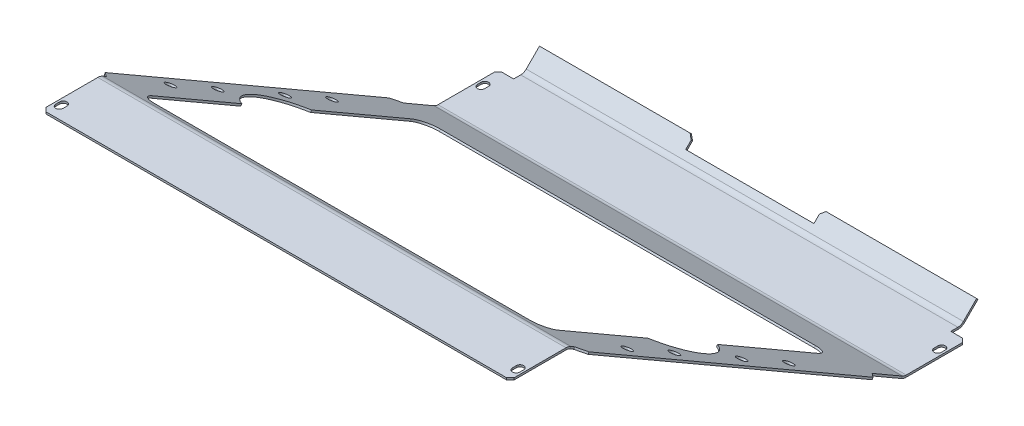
ISO-10303-21;
HEADER;
FILE_DESCRIPTION(('STEP AP214'),'2;1');
FILE_NAME('part.step','',(''),(''),'','','');
FILE_SCHEMA(('AUTOMOTIVE_DESIGN { 1 0 10303 214 1 1 1 1 }'));
ENDSEC;
DATA;
#1=APPLICATION_CONTEXT('core data for automotive mechanical design processes');
#2=APPLICATION_PROTOCOL_DEFINITION('international standard','automotive_design',2000,#1);
#3=PRODUCT_CONTEXT('',#1,'mechanical');
#4=PRODUCT('Part','Part','',(#3));
#5=PRODUCT_RELATED_PRODUCT_CATEGORY('part','',(#4));
#6=PRODUCT_DEFINITION_FORMATION('','',#4);
#7=PRODUCT_DEFINITION_CONTEXT('part definition',#1,'design');
#8=PRODUCT_DEFINITION('design','',#6,#7);
#9=PRODUCT_DEFINITION_SHAPE('','',#8);
#10=(LENGTH_UNIT() NAMED_UNIT(*) SI_UNIT(.MILLI.,.METRE.));
#11=(NAMED_UNIT(*) PLANE_ANGLE_UNIT() SI_UNIT($,.RADIAN.));
#12=(NAMED_UNIT(*) SI_UNIT($,.STERADIAN.) SOLID_ANGLE_UNIT());
#13=UNCERTAINTY_MEASURE_WITH_UNIT(LENGTH_MEASURE(1.E-05),#10,'distance_accuracy_value','');
#14=(GEOMETRIC_REPRESENTATION_CONTEXT(3) GLOBAL_UNCERTAINTY_ASSIGNED_CONTEXT((#13)) GLOBAL_UNIT_ASSIGNED_CONTEXT((#10,
#11,#12)) REPRESENTATION_CONTEXT('',''));
#15=CARTESIAN_POINT('',(0.,0.,0.));
#16=DIRECTION('',(0.,0.,1.));
#17=DIRECTION('',(1.,0.,0.));
#18=AXIS2_PLACEMENT_3D('',#15,#16,#17);
#19=CARTESIAN_POINT('',(191.29375,-145.576458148,-393.7));
#20=DIRECTION('',(0.,0.707106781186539,-0.707106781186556));
#21=DIRECTION('',(0.,0.707106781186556,0.707106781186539));
#22=AXIS2_PLACEMENT_3D('',#19,#20,#21);
#23=PLANE('',#22);
#24=DIRECTION('',(-1.,0.,0.));
#25=VECTOR('',#24,1.);
#26=CARTESIAN_POINT('',(191.29375,-145.576458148,-393.7));
#27=LINE('',#26,#25);
#28=CARTESIAN_POINT('',(-55.5625000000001,-145.576458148,-393.7));
#29=VERTEX_POINT('',#28);
#30=CARTESIAN_POINT('',(-178.59375,-145.576458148,-393.7));
#31=VERTEX_POINT('',#30);
#32=EDGE_CURVE('E923',#29,#31,#27,.T.);
#33=ORIENTED_EDGE('',*,*,#32,.F.);
#34=DIRECTION('',(0.,-0.707106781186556,-0.707106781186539));
#35=VECTOR('',#34,1.);
#36=CARTESIAN_POINT('',(-55.5625000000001,-146.698990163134,-394.822532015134));
#37=LINE('',#36,#35);
#38=CARTESIAN_POINT('',(-55.5625000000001,-146.698990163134,-394.822532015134));
#39=VERTEX_POINT('',#38);
#40=EDGE_CURVE('E1020',#29,#39,#37,.T.);
#41=ORIENTED_EDGE('',*,*,#40,.T.);
#42=DIRECTION('',(-1.,0.,0.));
#43=VECTOR('',#42,1.);
#44=CARTESIAN_POINT('',(191.29375,-146.698990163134,-394.822532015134));
#45=LINE('',#44,#43);
#46=CARTESIAN_POINT('',(-178.59375,-146.698990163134,-394.822532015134));
#47=VERTEX_POINT('',#46);
#48=EDGE_CURVE('E926',#39,#47,#45,.T.);
#49=ORIENTED_EDGE('',*,*,#48,.T.);
#50=DIRECTION('',(0.,0.707106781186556,0.707106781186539));
#51=VECTOR('',#50,1.);
#52=CARTESIAN_POINT('',(-178.59375,-145.576458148,-393.7));
#53=LINE('',#52,#51);
#54=EDGE_CURVE('E787',#47,#31,#53,.T.);
#55=ORIENTED_EDGE('',*,*,#54,.T.);
#56=EDGE_LOOP('',(#33,#41,#49,#55));
#57=FACE_BOUND('',#56,.T.);
#58=ADVANCED_FACE('F52',(#57),#23,.T.);
#59=CARTESIAN_POINT('',(191.29375,0.,-47.625));
#60=DIRECTION('',(0.,0.866025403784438,-0.500000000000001));
#61=DIRECTION('',(0.,0.500000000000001,0.866025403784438));
#62=AXIS2_PLACEMENT_3D('',#59,#60,#61);
#63=PLANE('',#62);
#64=CARTESIAN_POINT('',(-186.59475,-106.575184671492,-232.21863467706));
#65=DIRECTION('',(0.,0.866025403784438,-0.500000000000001));
#66=DIRECTION('',(0.,0.500000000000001,0.866025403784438));
#67=AXIS2_PLACEMENT_3D('',#64,#65,#66);
#68=CIRCLE('',#67,3.96811499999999);
#69=CARTESIAN_POINT('',(-186.59475,-104.591127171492,-228.782146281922));
#70=VERTEX_POINT('',#69);
#71=EDGE_CURVE('E680',#70,#70,#68,.T.);
#72=ORIENTED_EDGE('',*,*,#71,.F.);
#73=EDGE_LOOP('',(#72));
#74=FACE_BOUND('',#73,.T.);
#75=CARTESIAN_POINT('',(-186.59475,-30.3751846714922,-100.236363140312));
#76=DIRECTION('',(0.,0.866025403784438,-0.500000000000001));
#77=DIRECTION('',(0.,0.500000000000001,0.866025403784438));
#78=AXIS2_PLACEMENT_3D('',#75,#76,#77);
#79=CIRCLE('',#78,3.96811499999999);
#80=CARTESIAN_POINT('',(-186.59475,-28.3911271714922,-96.7998747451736));
#81=VERTEX_POINT('',#80);
#82=EDGE_CURVE('E686',#81,#81,#79,.T.);
#83=ORIENTED_EDGE('',*,*,#82,.F.);
#84=EDGE_LOOP('',(#83));
#85=FACE_BOUND('',#84,.T.);
#86=CARTESIAN_POINT('',(-186.59475,-52.6001846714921,-138.73119233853));
#87=DIRECTION('',(0.,0.866025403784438,-0.500000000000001));
#88=DIRECTION('',(0.,0.500000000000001,0.866025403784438));
#89=AXIS2_PLACEMENT_3D('',#86,#87,#88);
#90=CIRCLE('',#89,3.96811499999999);
#91=CARTESIAN_POINT('',(-186.59475,-50.6161271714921,-135.294703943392));
#92=VERTEX_POINT('',#91);
#93=EDGE_CURVE('E692',#92,#92,#90,.T.);
#94=ORIENTED_EDGE('',*,*,#93,.F.);
#95=EDGE_LOOP('',(#94));
#96=FACE_BOUND('',#95,.T.);
#97=CARTESIAN_POINT('',(-186.59475,-84.3501846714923,-193.723805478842));
#98=DIRECTION('',(0.,0.866025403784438,-0.500000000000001));
#99=DIRECTION('',(0.,0.500000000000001,0.866025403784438));
#100=AXIS2_PLACEMENT_3D('',#97,#98,#99);
#101=CIRCLE('',#100,3.96811499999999);
#102=CARTESIAN_POINT('',(-186.59475,-82.3661271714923,-190.287317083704));
#103=VERTEX_POINT('',#102);
#104=EDGE_CURVE('E698',#103,#103,#101,.T.);
#105=ORIENTED_EDGE('',*,*,#104,.F.);
#106=EDGE_LOOP('',(#105));
#107=FACE_BOUND('',#106,.T.);
#108=CARTESIAN_POINT('',(186.59475,-30.3751846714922,-100.236363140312));
#109=DIRECTION('',(0.,0.866025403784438,-0.500000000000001));
#110=DIRECTION('',(0.,0.500000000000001,0.866025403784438));
#111=AXIS2_PLACEMENT_3D('',#108,#109,#110);
#112=CIRCLE('',#111,3.96811499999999);
#113=CARTESIAN_POINT('',(186.59475,-28.3911271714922,-96.7998747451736));
#114=VERTEX_POINT('',#113);
#115=EDGE_CURVE('E704',#114,#114,#112,.T.);
#116=ORIENTED_EDGE('',*,*,#115,.F.);
#117=EDGE_LOOP('',(#116));
#118=FACE_BOUND('',#117,.T.);
#119=CARTESIAN_POINT('',(186.59475,-52.6001846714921,-138.73119233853));
#120=DIRECTION('',(0.,0.866025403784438,-0.500000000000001));
#121=DIRECTION('',(0.,0.500000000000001,0.866025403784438));
#122=AXIS2_PLACEMENT_3D('',#119,#120,#121);
#123=CIRCLE('',#122,3.96811499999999);
#124=CARTESIAN_POINT('',(186.59475,-50.6161271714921,-135.294703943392));
#125=VERTEX_POINT('',#124);
#126=EDGE_CURVE('E710',#125,#125,#123,.T.);
#127=ORIENTED_EDGE('',*,*,#126,.F.);
#128=EDGE_LOOP('',(#127));
#129=FACE_BOUND('',#128,.T.);
#130=CARTESIAN_POINT('',(186.59475,-84.3501846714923,-193.723805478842));
#131=DIRECTION('',(0.,0.866025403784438,-0.500000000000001));
#132=DIRECTION('',(0.,0.500000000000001,0.866025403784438));
#133=AXIS2_PLACEMENT_3D('',#130,#131,#132);
#134=CIRCLE('',#133,3.96811499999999);
#135=CARTESIAN_POINT('',(186.59475,-82.3661271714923,-190.287317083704));
#136=VERTEX_POINT('',#135);
#137=EDGE_CURVE('E716',#136,#136,#134,.T.);
#138=ORIENTED_EDGE('',*,*,#137,.F.);
#139=EDGE_LOOP('',(#138));
#140=FACE_BOUND('',#139,.T.);
#141=CARTESIAN_POINT('',(186.59475,-106.575184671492,-232.21863467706));
#142=DIRECTION('',(0.,0.866025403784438,-0.500000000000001));
#143=DIRECTION('',(0.,0.500000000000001,0.866025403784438));
#144=AXIS2_PLACEMENT_3D('',#141,#142,#143);
#145=CIRCLE('',#144,3.96811499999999);
#146=CARTESIAN_POINT('',(186.59475,-104.591127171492,-228.782146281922));
#147=VERTEX_POINT('',#146);
#148=EDGE_CURVE('E722',#147,#147,#145,.T.);
#149=ORIENTED_EDGE('',*,*,#148,.F.);
#150=EDGE_LOOP('',(#149));
#151=FACE_BOUND('',#150,.T.);
#152=DIRECTION('',(0.,-0.500000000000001,-0.866025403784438));
#153=VECTOR('',#152,1.);
#154=CARTESIAN_POINT('',(-191.29375,0.,-47.625));
#155=LINE('',#154,#153);
#156=CARTESIAN_POINT('',(-191.29375,-1.06342335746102,-49.466903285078));
#157=VERTEX_POINT('',#156);
#158=CARTESIAN_POINT('',(-191.29375,-2.79743138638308,-52.4702932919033));
#159=VERTEX_POINT('',#158);
#160=EDGE_CURVE('E858',#157,#159,#155,.T.);
#161=ORIENTED_EDGE('',*,*,#160,.F.);
#162=DIRECTION('',(-1.,0.,0.));
#163=VECTOR('',#162,1.);
#164=CARTESIAN_POINT('',(191.29375,-1.06342335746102,-49.466903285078));
#165=LINE('',#164,#163);
#166=CARTESIAN_POINT('',(191.29375,-1.06342335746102,-49.466903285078));
#167=VERTEX_POINT('',#166);
#168=EDGE_CURVE('E907',#167,#157,#165,.T.);
#169=ORIENTED_EDGE('',*,*,#168,.F.);
#170=DIRECTION('',(0.,-0.500000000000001,-0.866025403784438));
#171=VECTOR('',#170,1.);
#172=CARTESIAN_POINT('',(191.29375,0.,-47.625));
#173=LINE('',#172,#171);
#174=CARTESIAN_POINT('',(191.29375,-2.79743138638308,-52.4702932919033));
#175=VERTEX_POINT('',#174);
#176=EDGE_CURVE('E829',#167,#175,#173,.T.);
#177=ORIENTED_EDGE('',*,*,#176,.T.);
#178=DIRECTION('',(0.707106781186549,-0.353553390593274,-0.612372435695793));
#179=VECTOR('',#178,1.);
#180=CARTESIAN_POINT('',(191.29375,-2.79743138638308,-52.4702932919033));
#181=LINE('',#180,#179);
#182=CARTESIAN_POINT('',(197.64375,-5.9724313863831,-57.9695546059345));
#183=VERTEX_POINT('',#182);
#184=EDGE_CURVE('E655',#175,#183,#181,.T.);
#185=ORIENTED_EDGE('',*,*,#184,.T.);
#186=DIRECTION('',(0.,-0.500000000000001,-0.866025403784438));
#187=VECTOR('',#186,1.);
#188=CARTESIAN_POINT('',(197.64375,-5.9724313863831,-57.9695546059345));
#189=LINE('',#188,#187);
#190=CARTESIAN_POINT('',(197.64375,-139.963219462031,-290.04840729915));
#191=VERTEX_POINT('',#190);
#192=EDGE_CURVE('E664',#183,#191,#189,.T.);
#193=ORIENTED_EDGE('',*,*,#192,.T.);
#194=DIRECTION('',(-0.707106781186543,-0.353553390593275,-0.612372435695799));
#195=VECTOR('',#194,1.);
#196=CARTESIAN_POINT('',(197.64375,-139.963219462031,-290.04840729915));
#197=LINE('',#196,#195);
#198=CARTESIAN_POINT('',(191.29375,-143.138219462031,-295.547668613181));
#199=VERTEX_POINT('',#198);
#200=EDGE_CURVE('E667',#191,#199,#197,.T.);
#201=ORIENTED_EDGE('',*,*,#200,.T.);
#202=CARTESIAN_POINT('',(191.29375,-157.425719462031,-320.294344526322));
#203=VERTEX_POINT('',#202);
#204=EDGE_CURVE('E828',#199,#203,#173,.T.);
#205=ORIENTED_EDGE('',*,*,#204,.T.);
#206=DIRECTION('',(-1.,0.,0.));
#207=VECTOR('',#206,1.);
#208=CARTESIAN_POINT('',(191.29375,-157.425719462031,-320.294344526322));
#209=LINE('',#208,#207);
#210=CARTESIAN_POINT('',(-191.29375,-157.425719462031,-320.294344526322));
#211=VERTEX_POINT('',#210);
#212=EDGE_CURVE('E910',#203,#211,#209,.T.);
#213=ORIENTED_EDGE('',*,*,#212,.T.);
#214=CARTESIAN_POINT('',(-191.29375,-143.138219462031,-295.547668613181));
#215=VERTEX_POINT('',#214);
#216=EDGE_CURVE('E857',#215,#211,#155,.T.);
#217=ORIENTED_EDGE('',*,*,#216,.F.);
#218=DIRECTION('',(-0.707106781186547,0.353553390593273,0.612372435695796));
#219=VECTOR('',#218,1.);
#220=CARTESIAN_POINT('',(-197.64375,-139.963219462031,-290.04840729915));
#221=LINE('',#220,#219);
#222=CARTESIAN_POINT('',(-197.64375,-139.963219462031,-290.04840729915));
#223=VERTEX_POINT('',#222);
#224=EDGE_CURVE('E629',#215,#223,#221,.T.);
#225=ORIENTED_EDGE('',*,*,#224,.T.);
#226=DIRECTION('',(0.,0.500000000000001,0.866025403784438));
#227=VECTOR('',#226,1.);
#228=CARTESIAN_POINT('',(-197.64375,-5.9724313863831,-57.9695546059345));
#229=LINE('',#228,#227);
#230=CARTESIAN_POINT('',(-197.64375,-5.9724313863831,-57.9695546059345));
#231=VERTEX_POINT('',#230);
#232=EDGE_CURVE('E640',#223,#231,#229,.T.);
#233=ORIENTED_EDGE('',*,*,#232,.T.);
#234=DIRECTION('',(0.707106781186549,0.353553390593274,0.612372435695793));
#235=VECTOR('',#234,1.);
#236=CARTESIAN_POINT('',(-191.29375,-2.79743138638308,-52.4702932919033));
#237=LINE('',#236,#235);
#238=EDGE_CURVE('E643',#231,#159,#237,.T.);
#239=ORIENTED_EDGE('',*,*,#238,.T.);
#240=EDGE_LOOP('',(#161,#169,#177,#185,#193,#201,#205,#213,#217,#225,#233,#239));
#241=FACE_BOUND('',#240,.T.);
#242=DIRECTION('',(0.,0.500000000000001,0.866025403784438));
#243=VECTOR('',#242,1.);
#244=CARTESIAN_POINT('',(-165.89375,-9.94118138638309,-64.8436312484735));
#245=LINE('',#244,#243);
#246=CARTESIAN_POINT('',(-165.89375,-52.0347844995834,-137.751890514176));
#247=VERTEX_POINT('',#246);
#248=CARTESIAN_POINT('',(-165.89375,-9.94118138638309,-64.8436312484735));
#249=VERTEX_POINT('',#248);
#250=EDGE_CURVE('E744',#247,#249,#245,.T.);
#251=ORIENTED_EDGE('',*,*,#250,.F.);
#252=CARTESIAN_POINT('',(-143.66875,-68.4751846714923,-166.227498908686));
#253=DIRECTION('',(0.,0.866025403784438,-0.500000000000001));
#254=DIRECTION('',(0.,0.500000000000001,0.866025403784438));
#255=AXIS2_PLACEMENT_3D('',#252,#253,#254);
#256=CIRCLE('',#255,39.6875);
#257=CARTESIAN_POINT('',(-165.89375,-84.9155848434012,-194.703107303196));
#258=VERTEX_POINT('',#257);
#259=EDGE_CURVE('E611',#258,#247,#256,.T.);
#260=ORIENTED_EDGE('',*,*,#259,.F.);
#261=CARTESIAN_POINT('',(-165.89375,-132.025719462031,-276.300254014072));
#262=VERTEX_POINT('',#261);
#263=EDGE_CURVE('E745',#262,#258,#245,.T.);
#264=ORIENTED_EDGE('',*,*,#263,.F.);
#265=CARTESIAN_POINT('',(-153.19375,-132.025719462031,-276.300254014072));
#266=DIRECTION('',(0.,0.866025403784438,-0.500000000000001));
#267=DIRECTION('',(0.,0.500000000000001,0.866025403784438));
#268=AXIS2_PLACEMENT_3D('',#265,#266,#267);
#269=CIRCLE('',#268,12.7);
#270=CARTESIAN_POINT('',(-153.19375,-138.375719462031,-287.298776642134));
#271=VERTEX_POINT('',#270);
#272=EDGE_CURVE('E741',#271,#262,#269,.T.);
#273=ORIENTED_EDGE('',*,*,#272,.F.);
#274=DIRECTION('',(-1.,0.,0.));
#275=VECTOR('',#274,1.);
#276=CARTESIAN_POINT('',(-153.19375,-138.375719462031,-287.298776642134));
#277=LINE('',#276,#275);
#278=CARTESIAN_POINT('',(153.19375,-138.375719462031,-287.298776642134));
#279=VERTEX_POINT('',#278);
#280=EDGE_CURVE('E737',#279,#271,#277,.T.);
#281=ORIENTED_EDGE('',*,*,#280,.F.);
#282=CARTESIAN_POINT('',(153.19375,-132.025719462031,-276.300254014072));
#283=DIRECTION('',(0.,0.866025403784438,-0.500000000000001));
#284=DIRECTION('',(0.,0.500000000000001,0.866025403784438));
#285=AXIS2_PLACEMENT_3D('',#282,#283,#284);
#286=CIRCLE('',#285,12.7);
#287=CARTESIAN_POINT('',(165.89375,-132.025719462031,-276.300254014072));
#288=VERTEX_POINT('',#287);
#289=EDGE_CURVE('E734',#288,#279,#286,.T.);
#290=ORIENTED_EDGE('',*,*,#289,.F.);
#291=DIRECTION('',(0.,-0.500000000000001,-0.866025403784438));
#292=VECTOR('',#291,1.);
#293=CARTESIAN_POINT('',(165.89375,-9.94118138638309,-64.8436312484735));
#294=LINE('',#293,#292);
#295=CARTESIAN_POINT('',(165.89375,-84.9155848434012,-194.703107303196));
#296=VERTEX_POINT('',#295);
#297=EDGE_CURVE('E730',#296,#288,#294,.T.);
#298=ORIENTED_EDGE('',*,*,#297,.F.);
#299=CARTESIAN_POINT('',(143.66875,-68.4751846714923,-166.227498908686));
#300=DIRECTION('',(0.,0.866025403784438,-0.500000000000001));
#301=DIRECTION('',(0.,0.500000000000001,0.866025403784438));
#302=AXIS2_PLACEMENT_3D('',#299,#300,#301);
#303=CIRCLE('',#302,39.6875);
#304=CARTESIAN_POINT('',(165.89375,-52.0347844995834,-137.751890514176));
#305=VERTEX_POINT('',#304);
#306=EDGE_CURVE('E621',#305,#296,#303,.T.);
#307=ORIENTED_EDGE('',*,*,#306,.F.);
#308=CARTESIAN_POINT('',(165.89375,-9.94118138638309,-64.8436312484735));
#309=VERTEX_POINT('',#308);
#310=EDGE_CURVE('E731',#309,#305,#294,.T.);
#311=ORIENTED_EDGE('',*,*,#310,.F.);
#312=CARTESIAN_POINT('',(153.19375,-9.94118138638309,-64.8436312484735));
#313=DIRECTION('',(0.,0.866025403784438,-0.500000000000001));
#314=DIRECTION('',(0.,0.500000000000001,0.866025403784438));
#315=AXIS2_PLACEMENT_3D('',#312,#313,#314);
#316=CIRCLE('',#315,12.7);
#317=CARTESIAN_POINT('',(153.19375,-3.59118138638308,-53.8451086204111));
#318=VERTEX_POINT('',#317);
#319=EDGE_CURVE('E728',#318,#309,#316,.T.);
#320=ORIENTED_EDGE('',*,*,#319,.F.);
#321=DIRECTION('',(1.,0.,0.));
#322=VECTOR('',#321,1.);
#323=CARTESIAN_POINT('',(-153.19375,-3.59118138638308,-53.8451086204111));
#324=LINE('',#323,#322);
#325=CARTESIAN_POINT('',(-153.19375,-3.59118138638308,-53.8451086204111));
#326=VERTEX_POINT('',#325);
#327=EDGE_CURVE('E751',#326,#318,#324,.T.);
#328=ORIENTED_EDGE('',*,*,#327,.F.);
#329=CARTESIAN_POINT('',(-153.19375,-9.94118138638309,-64.8436312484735));
#330=DIRECTION('',(0.,0.866025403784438,-0.500000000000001));
#331=DIRECTION('',(0.,0.500000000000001,0.866025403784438));
#332=AXIS2_PLACEMENT_3D('',#329,#330,#331);
#333=CIRCLE('',#332,12.7);
#334=EDGE_CURVE('E748',#249,#326,#333,.T.);
#335=ORIENTED_EDGE('',*,*,#334,.F.);
#336=EDGE_LOOP('',(#251,#260,#264,#273,#281,#290,#298,#307,#311,#320,#328,#335));
#337=FACE_BOUND('',#336,.T.);
#338=ADVANCED_FACE('F1152',(#74,#85,#96,#107,#118,#129,#140,#151,#241,#337),#63,.T.);
#339=CARTESIAN_POINT('',(191.29375,-1.3748153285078,-46.83125));
#340=DIRECTION('',(0.,0.866025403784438,-0.500000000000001));
#341=DIRECTION('',(0.,0.500000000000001,0.866025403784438));
#342=AXIS2_PLACEMENT_3D('',#339,#340,#341);
#343=PLANE('',#342);
#344=CARTESIAN_POINT('',(-186.59475,-107.95,-231.42488467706));
#345=DIRECTION('',(0.,0.866025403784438,-0.500000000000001));
#346=DIRECTION('',(0.,0.500000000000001,0.866025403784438));
#347=AXIS2_PLACEMENT_3D('',#344,#345,#346);
#348=CIRCLE('',#347,3.96811499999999);
#349=CARTESIAN_POINT('',(-186.59475,-105.9659425,-227.988396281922));
#350=VERTEX_POINT('',#349);
#351=EDGE_CURVE('E683',#350,#350,#348,.T.);
#352=ORIENTED_EDGE('',*,*,#351,.T.);
#353=EDGE_LOOP('',(#352));
#354=FACE_BOUND('',#353,.T.);
#355=CARTESIAN_POINT('',(-186.59475,-31.75,-99.4426131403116));
#356=DIRECTION('',(0.,0.866025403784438,-0.500000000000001));
#357=DIRECTION('',(0.,0.500000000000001,0.866025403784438));
#358=AXIS2_PLACEMENT_3D('',#355,#356,#357);
#359=CIRCLE('',#358,3.96811499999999);
#360=CARTESIAN_POINT('',(-186.59475,-29.7659425,-96.0061247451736));
#361=VERTEX_POINT('',#360);
#362=EDGE_CURVE('E689',#361,#361,#359,.T.);
#363=ORIENTED_EDGE('',*,*,#362,.T.);
#364=EDGE_LOOP('',(#363));
#365=FACE_BOUND('',#364,.T.);
#366=CARTESIAN_POINT('',(-186.59475,-53.975,-137.93744233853));
#367=DIRECTION('',(0.,0.866025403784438,-0.500000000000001));
#368=DIRECTION('',(0.,0.500000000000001,0.866025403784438));
#369=AXIS2_PLACEMENT_3D('',#366,#367,#368);
#370=CIRCLE('',#369,3.96811499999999);
#371=CARTESIAN_POINT('',(-186.59475,-51.9909425,-134.500953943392));
#372=VERTEX_POINT('',#371);
#373=EDGE_CURVE('E695',#372,#372,#370,.T.);
#374=ORIENTED_EDGE('',*,*,#373,.T.);
#375=EDGE_LOOP('',(#374));
#376=FACE_BOUND('',#375,.T.);
#377=CARTESIAN_POINT('',(-186.59475,-85.7250000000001,-192.930055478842));
#378=DIRECTION('',(0.,0.866025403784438,-0.500000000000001));
#379=DIRECTION('',(0.,0.500000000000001,0.866025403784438));
#380=AXIS2_PLACEMENT_3D('',#377,#378,#379);
#381=CIRCLE('',#380,3.96811499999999);
#382=CARTESIAN_POINT('',(-186.59475,-83.7409425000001,-189.493567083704));
#383=VERTEX_POINT('',#382);
#384=EDGE_CURVE('E701',#383,#383,#381,.T.);
#385=ORIENTED_EDGE('',*,*,#384,.T.);
#386=EDGE_LOOP('',(#385));
#387=FACE_BOUND('',#386,.T.);
#388=CARTESIAN_POINT('',(186.59475,-31.75,-99.4426131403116));
#389=DIRECTION('',(0.,0.866025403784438,-0.500000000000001));
#390=DIRECTION('',(0.,0.500000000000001,0.866025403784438));
#391=AXIS2_PLACEMENT_3D('',#388,#389,#390);
#392=CIRCLE('',#391,3.96811499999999);
#393=CARTESIAN_POINT('',(186.59475,-29.7659425,-96.0061247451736));
#394=VERTEX_POINT('',#393);
#395=EDGE_CURVE('E707',#394,#394,#392,.T.);
#396=ORIENTED_EDGE('',*,*,#395,.T.);
#397=EDGE_LOOP('',(#396));
#398=FACE_BOUND('',#397,.T.);
#399=CARTESIAN_POINT('',(186.59475,-53.975,-137.93744233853));
#400=DIRECTION('',(0.,0.866025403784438,-0.500000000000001));
#401=DIRECTION('',(0.,0.500000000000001,0.866025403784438));
#402=AXIS2_PLACEMENT_3D('',#399,#400,#401);
#403=CIRCLE('',#402,3.96811499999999);
#404=CARTESIAN_POINT('',(186.59475,-51.9909425,-134.500953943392));
#405=VERTEX_POINT('',#404);
#406=EDGE_CURVE('E713',#405,#405,#403,.T.);
#407=ORIENTED_EDGE('',*,*,#406,.T.);
#408=EDGE_LOOP('',(#407));
#409=FACE_BOUND('',#408,.T.);
#410=CARTESIAN_POINT('',(186.59475,-85.7250000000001,-192.930055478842));
#411=DIRECTION('',(0.,0.866025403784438,-0.500000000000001));
#412=DIRECTION('',(0.,0.500000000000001,0.866025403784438));
#413=AXIS2_PLACEMENT_3D('',#410,#411,#412);
#414=CIRCLE('',#413,3.96811499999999);
#415=CARTESIAN_POINT('',(186.59475,-83.7409425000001,-189.493567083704));
#416=VERTEX_POINT('',#415);
#417=EDGE_CURVE('E719',#416,#416,#414,.T.);
#418=ORIENTED_EDGE('',*,*,#417,.T.);
#419=EDGE_LOOP('',(#418));
#420=FACE_BOUND('',#419,.T.);
#421=CARTESIAN_POINT('',(186.59475,-107.95,-231.42488467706));
#422=DIRECTION('',(0.,0.866025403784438,-0.500000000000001));
#423=DIRECTION('',(0.,0.500000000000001,0.866025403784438));
#424=AXIS2_PLACEMENT_3D('',#421,#422,#423);
#425=CIRCLE('',#424,3.96811499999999);
#426=CARTESIAN_POINT('',(186.59475,-105.9659425,-227.988396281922));
#427=VERTEX_POINT('',#426);
#428=EDGE_CURVE('E725',#427,#427,#425,.T.);
#429=ORIENTED_EDGE('',*,*,#428,.T.);
#430=EDGE_LOOP('',(#429));
#431=FACE_BOUND('',#430,.T.);
#432=DIRECTION('',(0.,-0.500000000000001,-0.866025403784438));
#433=VECTOR('',#432,1.);
#434=CARTESIAN_POINT('',(-191.29375,-1.3748153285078,-46.83125));
#435=LINE('',#434,#433);
#436=CARTESIAN_POINT('',(-191.29375,-2.43823868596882,-48.673153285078));
#437=VERTEX_POINT('',#436);
#438=CARTESIAN_POINT('',(-191.29375,-4.17224671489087,-51.6765432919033));
#439=VERTEX_POINT('',#438);
#440=EDGE_CURVE('E872',#437,#439,#435,.T.);
#441=ORIENTED_EDGE('',*,*,#440,.T.);
#442=DIRECTION('',(-0.707106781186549,-0.353553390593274,-0.612372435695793));
#443=VECTOR('',#442,1.);
#444=CARTESIAN_POINT('',(-191.29375,-4.17224671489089,-51.6765432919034));
#445=LINE('',#444,#443);
#446=CARTESIAN_POINT('',(-197.64375,-7.34724671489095,-57.1758046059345));
#447=VERTEX_POINT('',#446);
#448=EDGE_CURVE('E631',#439,#447,#445,.T.);
#449=ORIENTED_EDGE('',*,*,#448,.T.);
#450=DIRECTION('',(0.,-0.500000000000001,-0.866025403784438));
#451=VECTOR('',#450,1.);
#452=CARTESIAN_POINT('',(-197.64375,-7.34724671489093,-57.1758046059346));
#453=LINE('',#452,#451);
#454=CARTESIAN_POINT('',(-197.64375,-141.338034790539,-289.25465729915));
#455=VERTEX_POINT('',#454);
#456=EDGE_CURVE('E637',#447,#455,#453,.T.);
#457=ORIENTED_EDGE('',*,*,#456,.T.);
#458=DIRECTION('',(0.707106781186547,-0.353553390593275,-0.612372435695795));
#459=VECTOR('',#458,1.);
#460=CARTESIAN_POINT('',(-197.64375,-141.338034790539,-289.25465729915));
#461=LINE('',#460,#459);
#462=CARTESIAN_POINT('',(-191.29375,-144.513034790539,-294.753918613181));
#463=VERTEX_POINT('',#462);
#464=EDGE_CURVE('E633',#455,#463,#461,.T.);
#465=ORIENTED_EDGE('',*,*,#464,.T.);
#466=CARTESIAN_POINT('',(-191.29375,-158.800534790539,-319.500594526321));
#467=VERTEX_POINT('',#466);
#468=EDGE_CURVE('E871',#463,#467,#435,.T.);
#469=ORIENTED_EDGE('',*,*,#468,.T.);
#470=DIRECTION('',(-1.,0.,0.));
#471=VECTOR('',#470,1.);
#472=CARTESIAN_POINT('',(191.29375,-158.800534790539,-319.500594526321));
#473=LINE('',#472,#471);
#474=CARTESIAN_POINT('',(191.29375,-158.800534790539,-319.500594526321));
#475=VERTEX_POINT('',#474);
#476=EDGE_CURVE('E889',#475,#467,#473,.T.);
#477=ORIENTED_EDGE('',*,*,#476,.F.);
#478=DIRECTION('',(0.,-0.500000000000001,-0.866025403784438));
#479=VECTOR('',#478,1.);
#480=CARTESIAN_POINT('',(191.29375,-1.3748153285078,-46.83125));
#481=LINE('',#480,#479);
#482=CARTESIAN_POINT('',(191.29375,-144.513034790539,-294.753918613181));
#483=VERTEX_POINT('',#482);
#484=EDGE_CURVE('E842',#483,#475,#481,.T.);
#485=ORIENTED_EDGE('',*,*,#484,.F.);
#486=DIRECTION('',(0.707106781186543,0.353553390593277,0.612372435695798));
#487=VECTOR('',#486,1.);
#488=CARTESIAN_POINT('',(197.64375,-141.338034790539,-289.25465729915));
#489=LINE('',#488,#487);
#490=CARTESIAN_POINT('',(197.64375,-141.338034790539,-289.25465729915));
#491=VERTEX_POINT('',#490);
#492=EDGE_CURVE('E658',#483,#491,#489,.T.);
#493=ORIENTED_EDGE('',*,*,#492,.T.);
#494=DIRECTION('',(0.,0.500000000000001,0.866025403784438));
#495=VECTOR('',#494,1.);
#496=CARTESIAN_POINT('',(197.64375,-7.34724671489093,-57.1758046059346));
#497=LINE('',#496,#495);
#498=CARTESIAN_POINT('',(197.64375,-7.34724671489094,-57.1758046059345));
#499=VERTEX_POINT('',#498);
#500=EDGE_CURVE('E656',#491,#499,#497,.T.);
#501=ORIENTED_EDGE('',*,*,#500,.T.);
#502=DIRECTION('',(-0.707106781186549,0.353553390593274,0.612372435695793));
#503=VECTOR('',#502,1.);
#504=CARTESIAN_POINT('',(191.29375,-4.17224671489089,-51.6765432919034));
#505=LINE('',#504,#503);
#506=CARTESIAN_POINT('',(191.29375,-4.17224671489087,-51.6765432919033));
#507=VERTEX_POINT('',#506);
#508=EDGE_CURVE('E661',#499,#507,#505,.T.);
#509=ORIENTED_EDGE('',*,*,#508,.T.);
#510=CARTESIAN_POINT('',(191.29375,-2.43823868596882,-48.673153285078));
#511=VERTEX_POINT('',#510);
#512=EDGE_CURVE('E843',#511,#507,#481,.T.);
#513=ORIENTED_EDGE('',*,*,#512,.F.);
#514=DIRECTION('',(-1.,0.,0.));
#515=VECTOR('',#514,1.);
#516=CARTESIAN_POINT('',(191.29375,-2.43823868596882,-48.673153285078));
#517=LINE('',#516,#515);
#518=EDGE_CURVE('E892',#511,#437,#517,.T.);
#519=ORIENTED_EDGE('',*,*,#518,.T.);
#520=EDGE_LOOP('',(#441,#449,#457,#465,#469,#477,#485,#493,#501,#509,#513,#519));
#521=FACE_BOUND('',#520,.T.);
#522=CARTESIAN_POINT('',(-143.66875,-69.8500000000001,-165.433748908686));
#523=DIRECTION('',(0.,0.866025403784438,-0.500000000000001));
#524=DIRECTION('',(0.,0.500000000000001,0.866025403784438));
#525=AXIS2_PLACEMENT_3D('',#522,#523,#524);
#526=CIRCLE('',#525,39.6875);
#527=CARTESIAN_POINT('',(-165.89375,-86.290400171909,-193.909357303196));
#528=VERTEX_POINT('',#527);
#529=CARTESIAN_POINT('',(-165.89375,-53.4095998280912,-136.958140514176));
#530=VERTEX_POINT('',#529);
#531=EDGE_CURVE('E610',#528,#530,#526,.T.);
#532=ORIENTED_EDGE('',*,*,#531,.T.);
#533=DIRECTION('',(0.,0.500000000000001,0.866025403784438));
#534=VECTOR('',#533,1.);
#535=CARTESIAN_POINT('',(-165.89375,-1.37481532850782,-46.83125));
#536=LINE('',#535,#534);
#537=CARTESIAN_POINT('',(-165.89375,-11.3159967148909,-64.0498812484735));
#538=VERTEX_POINT('',#537);
#539=EDGE_CURVE('E980',#530,#538,#536,.T.);
#540=ORIENTED_EDGE('',*,*,#539,.T.);
#541=CARTESIAN_POINT('',(-153.19375,-11.3159967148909,-64.0498812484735));
#542=DIRECTION('',(0.,0.866025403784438,-0.500000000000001));
#543=DIRECTION('',(0.,0.500000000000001,0.866025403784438));
#544=AXIS2_PLACEMENT_3D('',#541,#542,#543);
#545=CIRCLE('',#544,12.7);
#546=CARTESIAN_POINT('',(-153.19375,-4.96599671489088,-53.0513586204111));
#547=VERTEX_POINT('',#546);
#548=EDGE_CURVE('E984',#538,#547,#545,.T.);
#549=ORIENTED_EDGE('',*,*,#548,.T.);
#550=DIRECTION('',(1.,0.,0.));
#551=VECTOR('',#550,1.);
#552=CARTESIAN_POINT('',(191.29375,-4.96599671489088,-53.0513586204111));
#553=LINE('',#552,#551);
#554=CARTESIAN_POINT('',(153.19375,-4.96599671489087,-53.0513586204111));
#555=VERTEX_POINT('',#554);
#556=EDGE_CURVE('E987',#547,#555,#553,.T.);
#557=ORIENTED_EDGE('',*,*,#556,.T.);
#558=CARTESIAN_POINT('',(153.19375,-11.3159967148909,-64.0498812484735));
#559=DIRECTION('',(0.,0.866025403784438,-0.500000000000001));
#560=DIRECTION('',(0.,0.500000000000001,0.866025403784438));
#561=AXIS2_PLACEMENT_3D('',#558,#559,#560);
#562=CIRCLE('',#561,12.7);
#563=CARTESIAN_POINT('',(165.89375,-11.3159967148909,-64.0498812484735));
#564=VERTEX_POINT('',#563);
#565=EDGE_CURVE('E990',#555,#564,#562,.T.);
#566=ORIENTED_EDGE('',*,*,#565,.T.);
#567=DIRECTION('',(0.,-0.500000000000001,-0.866025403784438));
#568=VECTOR('',#567,1.);
#569=CARTESIAN_POINT('',(165.89375,-1.37481532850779,-46.83125));
#570=LINE('',#569,#568);
#571=CARTESIAN_POINT('',(165.89375,-53.4095998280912,-136.958140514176));
#572=VERTEX_POINT('',#571);
#573=EDGE_CURVE('E967',#564,#572,#570,.T.);
#574=ORIENTED_EDGE('',*,*,#573,.T.);
#575=CARTESIAN_POINT('',(143.66875,-69.8500000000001,-165.433748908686));
#576=DIRECTION('',(0.,0.866025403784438,-0.500000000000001));
#577=DIRECTION('',(0.,0.500000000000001,0.866025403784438));
#578=AXIS2_PLACEMENT_3D('',#575,#576,#577);
#579=CIRCLE('',#578,39.6875);
#580=CARTESIAN_POINT('',(165.89375,-86.290400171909,-193.909357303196));
#581=VERTEX_POINT('',#580);
#582=EDGE_CURVE('E619',#572,#581,#579,.T.);
#583=ORIENTED_EDGE('',*,*,#582,.T.);
#584=CARTESIAN_POINT('',(165.89375,-133.400534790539,-275.506504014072));
#585=VERTEX_POINT('',#584);
#586=EDGE_CURVE('E966',#581,#585,#570,.T.);
#587=ORIENTED_EDGE('',*,*,#586,.T.);
#588=CARTESIAN_POINT('',(153.19375,-133.400534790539,-275.506504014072));
#589=DIRECTION('',(0.,0.866025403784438,-0.500000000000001));
#590=DIRECTION('',(0.,0.500000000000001,0.866025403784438));
#591=AXIS2_PLACEMENT_3D('',#588,#589,#590);
#592=CIRCLE('',#591,12.7);
#593=CARTESIAN_POINT('',(153.19375,-139.750534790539,-286.505026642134));
#594=VERTEX_POINT('',#593);
#595=EDGE_CURVE('E970',#585,#594,#592,.T.);
#596=ORIENTED_EDGE('',*,*,#595,.T.);
#597=DIRECTION('',(-1.,0.,0.));
#598=VECTOR('',#597,1.);
#599=CARTESIAN_POINT('',(191.29375,-139.750534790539,-286.505026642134));
#600=LINE('',#599,#598);
#601=CARTESIAN_POINT('',(-153.19375,-139.750534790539,-286.505026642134));
#602=VERTEX_POINT('',#601);
#603=EDGE_CURVE('E973',#594,#602,#600,.T.);
#604=ORIENTED_EDGE('',*,*,#603,.T.);
#605=CARTESIAN_POINT('',(-153.19375,-133.400534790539,-275.506504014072));
#606=DIRECTION('',(0.,0.866025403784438,-0.500000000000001));
#607=DIRECTION('',(0.,0.500000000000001,0.866025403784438));
#608=AXIS2_PLACEMENT_3D('',#605,#606,#607);
#609=CIRCLE('',#608,12.7);
#610=CARTESIAN_POINT('',(-165.89375,-133.400534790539,-275.506504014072));
#611=VERTEX_POINT('',#610);
#612=EDGE_CURVE('E977',#602,#611,#609,.T.);
#613=ORIENTED_EDGE('',*,*,#612,.T.);
#614=EDGE_CURVE('E981',#611,#528,#536,.T.);
#615=ORIENTED_EDGE('',*,*,#614,.T.);
#616=EDGE_LOOP('',(#532,#540,#549,#557,#566,#574,#583,#587,#596,#604,#613,#615));
#617=FACE_BOUND('',#616,.T.);
#618=ADVANCED_FACE('F1160',(#354,#365,#376,#387,#398,#409,#420,#431,#521,#617),#343,.F.);
#619=CARTESIAN_POINT('',(-165.89375,-12.6908120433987,-63.2561312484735));
#620=DIRECTION('',(-1.,0.,0.));
#621=DIRECTION('',(0.,0.,1.));
#622=AXIS2_PLACEMENT_3D('',#619,#620,#621);
#623=PLANE('',#622);
#624=DIRECTION('',(0.,-0.866025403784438,0.500000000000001));
#625=VECTOR('',#624,1.);
#626=CARTESIAN_POINT('',(-165.89375,-53.4095998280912,-136.958140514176));
#627=LINE('',#626,#625);
#628=EDGE_CURVE('E616',#530,#247,#627,.F.);
#629=ORIENTED_EDGE('',*,*,#628,.T.);
#630=ORIENTED_EDGE('',*,*,#250,.T.);
#631=DIRECTION('',(0.,0.866025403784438,-0.500000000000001));
#632=VECTOR('',#631,1.);
#633=CARTESIAN_POINT('',(-165.89375,-12.6908120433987,-63.2561312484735));
#634=LINE('',#633,#632);
#635=EDGE_CURVE('E760',#538,#249,#634,.T.);
#636=ORIENTED_EDGE('',*,*,#635,.F.);
#637=ORIENTED_EDGE('',*,*,#539,.F.);
#638=EDGE_LOOP('',(#629,#630,#636,#637));
#639=FACE_BOUND('',#638,.T.);
#640=ADVANCED_FACE('F1711',(#639),#623,.F.);
#641=DIRECTION('',(0.,-0.866025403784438,0.500000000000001));
#642=VECTOR('',#641,1.);
#643=CARTESIAN_POINT('',(-165.89375,-86.2904001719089,-193.909357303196));
#644=LINE('',#643,#642);
#645=EDGE_CURVE('E613',#528,#258,#644,.F.);
#646=ORIENTED_EDGE('',*,*,#645,.F.);
#647=ORIENTED_EDGE('',*,*,#614,.F.);
#648=DIRECTION('',(0.,0.866025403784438,-0.500000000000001));
#649=VECTOR('',#648,1.);
#650=CARTESIAN_POINT('',(-165.89375,-134.775350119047,-274.712754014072));
#651=LINE('',#650,#649);
#652=EDGE_CURVE('E763',#611,#262,#651,.T.);
#653=ORIENTED_EDGE('',*,*,#652,.T.);
#654=ORIENTED_EDGE('',*,*,#263,.T.);
#655=EDGE_LOOP('',(#646,#647,#653,#654));
#656=FACE_BOUND('',#655,.T.);
#657=ADVANCED_FACE('F1702',(#656),#623,.F.);
#658=CARTESIAN_POINT('',(165.89375,-12.6908120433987,-63.2561312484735));
#659=DIRECTION('',(1.,0.,0.));
#660=DIRECTION('',(0.,0.,-1.));
#661=AXIS2_PLACEMENT_3D('',#658,#659,#660);
#662=PLANE('',#661);
#663=DIRECTION('',(0.,-0.866025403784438,0.500000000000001));
#664=VECTOR('',#663,1.);
#665=CARTESIAN_POINT('',(165.89375,-86.290400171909,-193.909357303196));
#666=LINE('',#665,#664);
#667=EDGE_CURVE('E626',#581,#296,#666,.F.);
#668=ORIENTED_EDGE('',*,*,#667,.T.);
#669=ORIENTED_EDGE('',*,*,#297,.T.);
#670=DIRECTION('',(0.,0.866025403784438,-0.500000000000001));
#671=VECTOR('',#670,1.);
#672=CARTESIAN_POINT('',(165.89375,-134.775350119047,-274.712754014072));
#673=LINE('',#672,#671);
#674=EDGE_CURVE('E769',#585,#288,#673,.T.);
#675=ORIENTED_EDGE('',*,*,#674,.F.);
#676=ORIENTED_EDGE('',*,*,#586,.F.);
#677=EDGE_LOOP('',(#668,#669,#675,#676));
#678=FACE_BOUND('',#677,.T.);
#679=ADVANCED_FACE('F1690',(#678),#662,.F.);
#680=DIRECTION('',(0.,-0.866025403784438,0.500000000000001));
#681=VECTOR('',#680,1.);
#682=CARTESIAN_POINT('',(165.89375,-53.4095998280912,-136.958140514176));
#683=LINE('',#682,#681);
#684=EDGE_CURVE('E623',#572,#305,#683,.F.);
#685=ORIENTED_EDGE('',*,*,#684,.F.);
#686=ORIENTED_EDGE('',*,*,#573,.F.);
#687=DIRECTION('',(0.,0.866025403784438,-0.500000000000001));
#688=VECTOR('',#687,1.);
#689=CARTESIAN_POINT('',(165.89375,-12.6908120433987,-63.2561312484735));
#690=LINE('',#689,#688);
#691=EDGE_CURVE('E754',#564,#309,#690,.T.);
#692=ORIENTED_EDGE('',*,*,#691,.T.);
#693=ORIENTED_EDGE('',*,*,#310,.T.);
#694=EDGE_LOOP('',(#685,#686,#692,#693));
#695=FACE_BOUND('',#694,.T.);
#696=ADVANCED_FACE('F1685',(#695),#662,.F.);
#697=CARTESIAN_POINT('',(-191.29375,-159.863958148,-323.469344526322));
#698=DIRECTION('',(-1.,0.,0.));
#699=DIRECTION('',(0.,0.,1.));
#700=AXIS2_PLACEMENT_3D('',#697,#698,#699);
#701=PLANE('',#700);
#702=DIRECTION('',(0.,0.866025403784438,-0.500000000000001));
#703=VECTOR('',#702,1.);
#704=CARTESIAN_POINT('',(-191.29375,-387.65260842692,-154.377220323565));
#705=LINE('',#704,#703);
#706=EDGE_CURVE('E634',#463,#215,#705,.T.);
#707=ORIENTED_EDGE('',*,*,#706,.T.);
#708=ORIENTED_EDGE('',*,*,#216,.T.);
#709=DIRECTION('',(0.,-0.86602540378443,0.500000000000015));
#710=VECTOR('',#709,1.);
#711=CARTESIAN_POINT('',(-191.29375,-157.425719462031,-320.294344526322));
#712=LINE('',#711,#710);
#713=EDGE_CURVE('E932',#211,#467,#712,.T.);
#714=ORIENTED_EDGE('',*,*,#713,.T.);
#715=ORIENTED_EDGE('',*,*,#468,.F.);
#716=EDGE_LOOP('',(#707,#708,#714,#715));
#717=FACE_BOUND('',#716,.T.);
#718=ADVANCED_FACE('F1164',(#717),#701,.T.);
#719=CARTESIAN_POINT('',(191.29375,-1.5875,-45.498153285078));
#720=DIRECTION('',(1.,0.,0.));
#721=DIRECTION('',(0.,0.,-1.));
#722=AXIS2_PLACEMENT_3D('',#719,#720,#721);
#723=PLANE('',#722);
#724=DIRECTION('',(0.,0.866025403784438,-0.500000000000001));
#725=VECTOR('',#724,1.);
#726=CARTESIAN_POINT('',(191.29375,-387.65260842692,-154.377220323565));
#727=LINE('',#726,#725);
#728=EDGE_CURVE('E659',#483,#199,#727,.T.);
#729=ORIENTED_EDGE('',*,*,#728,.F.);
#730=ORIENTED_EDGE('',*,*,#484,.T.);
#731=DIRECTION('',(0.,0.86602540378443,-0.500000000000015));
#732=VECTOR('',#731,1.);
#733=CARTESIAN_POINT('',(191.29375,-158.800534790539,-319.500594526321));
#734=LINE('',#733,#732);
#735=EDGE_CURVE('E935',#475,#203,#734,.T.);
#736=ORIENTED_EDGE('',*,*,#735,.T.);
#737=ORIENTED_EDGE('',*,*,#204,.F.);
#738=EDGE_LOOP('',(#729,#730,#736,#737));
#739=FACE_BOUND('',#738,.T.);
#740=ADVANCED_FACE('F1157',(#739),#723,.T.);
#741=CARTESIAN_POINT('',(-178.59375,-164.626458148,-394.822532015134));
#742=DIRECTION('',(-1.,0.,0.));
#743=DIRECTION('',(0.,0.,1.));
#744=AXIS2_PLACEMENT_3D('',#741,#742,#743);
#745=PLANE('',#744);
#746=DIRECTION('',(0.,-0.707106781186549,0.707106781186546));
#747=VECTOR('',#746,1.);
#748=CARTESIAN_POINT('',(-178.59375,-159.398990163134,-382.122532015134));
#749=LINE('',#748,#747);
#750=CARTESIAN_POINT('',(-178.59375,-157.539118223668,-383.982403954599));
#751=VERTEX_POINT('',#750);
#752=EDGE_CURVE('E784',#47,#751,#749,.T.);
#753=ORIENTED_EDGE('',*,*,#752,.T.);
#754=DIRECTION('',(0.,0.707106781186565,0.70710678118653));
#755=VECTOR('',#754,1.);
#756=CARTESIAN_POINT('',(-178.59375,-157.539118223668,-383.982403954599));
#757=LINE('',#756,#755);
#758=CARTESIAN_POINT('',(-178.59375,-156.416586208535,-382.859871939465));
#759=VERTEX_POINT('',#758);
#760=EDGE_CURVE('E964',#751,#759,#757,.T.);
#761=ORIENTED_EDGE('',*,*,#760,.T.);
#762=DIRECTION('',(0.,-0.707106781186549,0.707106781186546));
#763=VECTOR('',#762,1.);
#764=CARTESIAN_POINT('',(-178.59375,-158.276458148,-381.));
#765=LINE('',#764,#763);
#766=EDGE_CURVE('E790',#31,#759,#765,.T.);
#767=ORIENTED_EDGE('',*,*,#766,.F.);
#768=ORIENTED_EDGE('',*,*,#54,.F.);
#769=EDGE_LOOP('',(#753,#761,#767,#768));
#770=FACE_BOUND('',#769,.T.);
#771=ADVANCED_FACE('F1098',(#770),#745,.T.);
#772=DIRECTION('',(0.,0.,1.));
#773=VECTOR('',#772,1.);
#774=CARTESIAN_POINT('',(-178.59375,-158.276458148,-321.767867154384));
#775=LINE('',#774,#773);
#776=CARTESIAN_POINT('',(-178.59375,-158.276458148,-378.369743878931));
#777=VERTEX_POINT('',#776);
#778=CARTESIAN_POINT('',(-178.59375,-158.276458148,-372.597532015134));
#779=VERTEX_POINT('',#778);
#780=EDGE_CURVE('E796',#777,#779,#775,.T.);
#781=ORIENTED_EDGE('',*,*,#780,.F.);
#782=DIRECTION('',(0.,-1.,0.));
#783=VECTOR('',#782,1.);
#784=CARTESIAN_POINT('',(-178.59375,-158.276458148,-378.369743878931));
#785=LINE('',#784,#783);
#786=CARTESIAN_POINT('',(-178.59375,-159.863958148,-378.369743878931));
#787=VERTEX_POINT('',#786);
#788=EDGE_CURVE('E962',#777,#787,#785,.T.);
#789=ORIENTED_EDGE('',*,*,#788,.T.);
#790=DIRECTION('',(0.,0.,1.));
#791=VECTOR('',#790,1.);
#792=CARTESIAN_POINT('',(-178.59375,-159.863958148,-321.767867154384));
#793=LINE('',#792,#791);
#794=CARTESIAN_POINT('',(-178.59375,-159.863958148,-372.597532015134));
#795=VERTEX_POINT('',#794);
#796=EDGE_CURVE('E782',#787,#795,#793,.T.);
#797=ORIENTED_EDGE('',*,*,#796,.T.);
#798=DIRECTION('',(0.,1.,0.));
#799=VECTOR('',#798,1.);
#800=CARTESIAN_POINT('',(-178.59375,-164.626458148,-372.597532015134));
#801=LINE('',#800,#799);
#802=EDGE_CURVE('E757',#795,#779,#801,.T.);
#803=ORIENTED_EDGE('',*,*,#802,.T.);
#804=EDGE_LOOP('',(#781,#789,#797,#803));
#805=FACE_BOUND('',#804,.T.);
#806=ADVANCED_FACE('F1134',(#805),#745,.T.);
#807=CARTESIAN_POINT('',(178.59375,-164.626458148,-394.822532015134));
#808=DIRECTION('',(1.,0.,0.));
#809=DIRECTION('',(0.,0.,-1.));
#810=AXIS2_PLACEMENT_3D('',#807,#808,#809);
#811=PLANE('',#810);
#812=DIRECTION('',(0.,0.707106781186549,-0.707106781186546));
#813=VECTOR('',#812,1.);
#814=CARTESIAN_POINT('',(178.59375,-158.276458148,-381.));
#815=LINE('',#814,#813);
#816=CARTESIAN_POINT('',(178.59375,-156.416586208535,-382.859871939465));
#817=VERTEX_POINT('',#816);
#818=CARTESIAN_POINT('',(178.59375,-145.576458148,-393.7));
#819=VERTEX_POINT('',#818);
#820=EDGE_CURVE('E810',#817,#819,#815,.T.);
#821=ORIENTED_EDGE('',*,*,#820,.F.);
#822=DIRECTION('',(0.,-0.707106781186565,-0.70710678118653));
#823=VECTOR('',#822,1.);
#824=CARTESIAN_POINT('',(178.59375,-156.416586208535,-382.859871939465));
#825=LINE('',#824,#823);
#826=CARTESIAN_POINT('',(178.59375,-157.539118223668,-383.982403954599));
#827=VERTEX_POINT('',#826);
#828=EDGE_CURVE('E960',#817,#827,#825,.T.);
#829=ORIENTED_EDGE('',*,*,#828,.T.);
#830=DIRECTION('',(0.,0.707106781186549,-0.707106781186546));
#831=VECTOR('',#830,1.);
#832=CARTESIAN_POINT('',(178.59375,-159.398990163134,-382.122532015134));
#833=LINE('',#832,#831);
#834=CARTESIAN_POINT('',(178.59375,-146.698990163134,-394.822532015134));
#835=VERTEX_POINT('',#834);
#836=EDGE_CURVE('E805',#827,#835,#833,.T.);
#837=ORIENTED_EDGE('',*,*,#836,.T.);
#838=DIRECTION('',(0.,-0.707106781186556,-0.707106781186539));
#839=VECTOR('',#838,1.);
#840=CARTESIAN_POINT('',(178.59375,-145.576458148,-393.7));
#841=LINE('',#840,#839);
#842=EDGE_CURVE('E807',#819,#835,#841,.T.);
#843=ORIENTED_EDGE('',*,*,#842,.F.);
#844=EDGE_LOOP('',(#821,#829,#837,#843));
#845=FACE_BOUND('',#844,.T.);
#846=ADVANCED_FACE('F1237',(#845),#811,.T.);
#847=DIRECTION('',(0.,0.,-1.));
#848=VECTOR('',#847,1.);
#849=CARTESIAN_POINT('',(178.59375,-159.863958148,-321.767867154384));
#850=LINE('',#849,#848);
#851=CARTESIAN_POINT('',(178.59375,-159.863958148,-372.597532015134));
#852=VERTEX_POINT('',#851);
#853=CARTESIAN_POINT('',(178.59375,-159.863958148,-378.369743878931));
#854=VERTEX_POINT('',#853);
#855=EDGE_CURVE('E802',#852,#854,#850,.T.);
#856=ORIENTED_EDGE('',*,*,#855,.T.);
#857=DIRECTION('',(0.,1.,0.));
#858=VECTOR('',#857,1.);
#859=CARTESIAN_POINT('',(178.59375,-159.863958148,-378.369743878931));
#860=LINE('',#859,#858);
#861=CARTESIAN_POINT('',(178.59375,-158.276458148,-378.369743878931));
#862=VERTEX_POINT('',#861);
#863=EDGE_CURVE('E958',#854,#862,#860,.T.);
#864=ORIENTED_EDGE('',*,*,#863,.T.);
#865=DIRECTION('',(0.,0.,-1.));
#866=VECTOR('',#865,1.);
#867=CARTESIAN_POINT('',(178.59375,-158.276458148,-321.767867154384));
#868=LINE('',#867,#866);
#869=CARTESIAN_POINT('',(178.59375,-158.276458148,-372.597532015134));
#870=VERTEX_POINT('',#869);
#871=EDGE_CURVE('E816',#870,#862,#868,.T.);
#872=ORIENTED_EDGE('',*,*,#871,.F.);
#873=DIRECTION('',(0.,1.,0.));
#874=VECTOR('',#873,1.);
#875=CARTESIAN_POINT('',(178.59375,-164.626458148,-372.597532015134));
#876=LINE('',#875,#874);
#877=EDGE_CURVE('E799',#852,#870,#876,.T.);
#878=ORIENTED_EDGE('',*,*,#877,.F.);
#879=EDGE_LOOP('',(#856,#864,#872,#878));
#880=FACE_BOUND('',#879,.T.);
#881=ADVANCED_FACE('F1084',(#880),#811,.T.);
#882=CARTESIAN_POINT('',(191.29375,-159.398990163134,-382.122532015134));
#883=DIRECTION('',(0.,0.707106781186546,0.707106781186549));
#884=DIRECTION('',(0.,-0.707106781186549,0.707106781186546));
#885=AXIS2_PLACEMENT_3D('',#882,#883,#884);
#886=PLANE('',#885);
#887=DIRECTION('',(0.,0.707106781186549,-0.707106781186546));
#888=VECTOR('',#887,1.);
#889=CARTESIAN_POINT('',(52.3875,-159.398990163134,-382.122532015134));
#890=LINE('',#889,#888);
#891=CARTESIAN_POINT('',(52.3875,-153.434182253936,-388.087339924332));
#892=VERTEX_POINT('',#891);
#893=CARTESIAN_POINT('',(52.3875,-148.944054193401,-392.577467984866));
#894=VERTEX_POINT('',#893);
#895=EDGE_CURVE('E471',#892,#894,#890,.T.);
#896=ORIENTED_EDGE('',*,*,#895,.T.);
#897=DIRECTION('',(0.70710678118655,0.5,-0.499999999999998));
#898=VECTOR('',#897,1.);
#899=CARTESIAN_POINT('',(55.5625,-146.698990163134,-394.822532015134));
#900=LINE('',#899,#898);
#901=CARTESIAN_POINT('',(55.5625000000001,-146.698990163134,-394.822532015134));
#902=VERTEX_POINT('',#901);
#903=EDGE_CURVE('E1015',#894,#902,#900,.T.);
#904=ORIENTED_EDGE('',*,*,#903,.T.);
#905=EDGE_CURVE('E927',#835,#902,#45,.T.);
#906=ORIENTED_EDGE('',*,*,#905,.F.);
#907=ORIENTED_EDGE('',*,*,#836,.F.);
#908=DIRECTION('',(-1.,0.,0.));
#909=VECTOR('',#908,1.);
#910=CARTESIAN_POINT('',(191.29375,-157.539118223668,-383.982403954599));
#911=LINE('',#910,#909);
#912=EDGE_CURVE('E851',#827,#751,#911,.T.);
#913=ORIENTED_EDGE('',*,*,#912,.T.);
#914=ORIENTED_EDGE('',*,*,#752,.F.);
#915=ORIENTED_EDGE('',*,*,#48,.F.);
#916=DIRECTION('',(0.707106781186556,-0.499999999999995,0.499999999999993));
#917=VECTOR('',#916,1.);
#918=CARTESIAN_POINT('',(-52.3874999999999,-148.944054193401,-392.577467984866));
#919=LINE('',#918,#917);
#920=CARTESIAN_POINT('',(-52.3875,-148.944054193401,-392.577467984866));
#921=VERTEX_POINT('',#920);
#922=EDGE_CURVE('E1013',#39,#921,#919,.T.);
#923=ORIENTED_EDGE('',*,*,#922,.T.);
#924=DIRECTION('',(0.,-0.707106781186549,0.707106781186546));
#925=VECTOR('',#924,1.);
#926=CARTESIAN_POINT('',(-52.3875,-159.398990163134,-382.122532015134));
#927=LINE('',#926,#925);
#928=CARTESIAN_POINT('',(-52.3875,-153.434182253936,-388.087339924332));
#929=VERTEX_POINT('',#928);
#930=EDGE_CURVE('E498',#921,#929,#927,.T.);
#931=ORIENTED_EDGE('',*,*,#930,.T.);
#932=DIRECTION('',(1.,0.,0.));
#933=VECTOR('',#932,1.);
#934=CARTESIAN_POINT('',(191.29375,-153.434182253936,-388.087339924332));
#935=LINE('',#934,#933);
#936=EDGE_CURVE('E475',#929,#892,#935,.T.);
#937=ORIENTED_EDGE('',*,*,#936,.T.);
#938=EDGE_LOOP('',(#896,#904,#906,#907,#913,#914,#915,#923,#931,#937));
#939=FACE_BOUND('',#938,.T.);
#940=ADVANCED_FACE('F1106',(#939),#886,.F.);
#941=ORIENTED_EDGE('',*,*,#905,.T.);
#942=DIRECTION('',(0.,0.707106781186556,0.707106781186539));
#943=VECTOR('',#942,1.);
#944=CARTESIAN_POINT('',(55.5625,-145.576458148,-393.7));
#945=LINE('',#944,#943);
#946=CARTESIAN_POINT('',(55.5625,-145.576458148,-393.7));
#947=VERTEX_POINT('',#946);
#948=EDGE_CURVE('E1005',#902,#947,#945,.T.);
#949=ORIENTED_EDGE('',*,*,#948,.T.);
#950=EDGE_CURVE('E924',#819,#947,#27,.T.);
#951=ORIENTED_EDGE('',*,*,#950,.F.);
#952=ORIENTED_EDGE('',*,*,#842,.T.);
#953=EDGE_LOOP('',(#941,#949,#951,#952));
#954=FACE_BOUND('',#953,.T.);
#955=ADVANCED_FACE('F1119',(#954),#23,.T.);
#956=CARTESIAN_POINT('',(191.29375,-158.276458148,-381.));
#957=DIRECTION('',(0.,0.707106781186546,0.707106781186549));
#958=DIRECTION('',(0.,-0.707106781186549,0.707106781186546));
#959=AXIS2_PLACEMENT_3D('',#956,#957,#958);
#960=PLANE('',#959);
#961=ORIENTED_EDGE('',*,*,#950,.T.);
#962=DIRECTION('',(-0.70710678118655,-0.5,0.499999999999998));
#963=VECTOR('',#962,1.);
#964=CARTESIAN_POINT('',(114.447868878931,-103.938214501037,-435.338243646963));
#965=LINE('',#964,#963);
#966=CARTESIAN_POINT('',(52.3875,-147.821522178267,-391.454935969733));
#967=VERTEX_POINT('',#966);
#968=EDGE_CURVE('E490',#947,#967,#965,.T.);
#969=ORIENTED_EDGE('',*,*,#968,.T.);
#970=DIRECTION('',(0.,0.707106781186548,-0.707106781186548));
#971=VECTOR('',#970,1.);
#972=CARTESIAN_POINT('',(52.3875,-145.576458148,-393.7));
#973=LINE('',#972,#971);
#974=CARTESIAN_POINT('',(52.3875,-152.311650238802,-386.964807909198));
#975=VERTEX_POINT('',#974);
#976=EDGE_CURVE('E468',#975,#967,#973,.T.);
#977=ORIENTED_EDGE('',*,*,#976,.F.);
#978=DIRECTION('',(1.,0.,0.));
#979=VECTOR('',#978,1.);
#980=CARTESIAN_POINT('',(-52.3875,-152.311650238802,-386.964807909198));
#981=LINE('',#980,#979);
#982=CARTESIAN_POINT('',(-52.3875,-152.311650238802,-386.964807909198));
#983=VERTEX_POINT('',#982);
#984=EDGE_CURVE('E480',#983,#975,#981,.T.);
#985=ORIENTED_EDGE('',*,*,#984,.F.);
#986=DIRECTION('',(0.,-0.707106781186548,0.707106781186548));
#987=VECTOR('',#986,1.);
#988=CARTESIAN_POINT('',(-52.3875,-145.576458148,-393.7));
#989=LINE('',#988,#987);
#990=CARTESIAN_POINT('',(-52.3875,-147.821522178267,-391.454935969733));
#991=VERTEX_POINT('',#990);
#992=EDGE_CURVE('E486',#991,#983,#989,.T.);
#993=ORIENTED_EDGE('',*,*,#992,.F.);
#994=DIRECTION('',(-0.707106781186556,0.499999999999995,-0.499999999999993));
#995=VECTOR('',#994,1.);
#996=CARTESIAN_POINT('',(76.8458811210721,-239.203322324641,-300.07313582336));
#997=LINE('',#996,#995);
#998=EDGE_CURVE('E1008',#991,#29,#997,.T.);
#999=ORIENTED_EDGE('',*,*,#998,.T.);
#1000=ORIENTED_EDGE('',*,*,#32,.T.);
#1001=ORIENTED_EDGE('',*,*,#766,.T.);
#1002=DIRECTION('',(-1.,0.,0.));
#1003=VECTOR('',#1002,1.);
#1004=CARTESIAN_POINT('',(191.29375,-156.416586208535,-382.859871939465));
#1005=LINE('',#1004,#1003);
#1006=EDGE_CURVE('E919',#817,#759,#1005,.T.);
#1007=ORIENTED_EDGE('',*,*,#1006,.F.);
#1008=ORIENTED_EDGE('',*,*,#820,.T.);
#1009=EDGE_LOOP('',(#961,#969,#977,#985,#993,#999,#1000,#1001,#1007,#1008));
#1010=FACE_BOUND('',#1009,.T.);
#1011=ADVANCED_FACE('F489',(#1010),#960,.T.);
#1012=CARTESIAN_POINT('',(191.29375,-151.926458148,-378.369743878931));
#1013=DIRECTION('',(-1.,0.,0.));
#1014=DIRECTION('',(0.,0.,1.));
#1015=AXIS2_PLACEMENT_3D('',#1012,#1013,#1014);
#1016=CYLINDRICAL_SURFACE('',#1015,6.35);
#1017=ORIENTED_EDGE('',*,*,#1006,.T.);
#1018=CARTESIAN_POINT('',(-178.59375,-151.926458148,-378.369743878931));
#1019=DIRECTION('',(-1.,0.,0.));
#1020=DIRECTION('',(0.,0.,1.));
#1021=AXIS2_PLACEMENT_3D('',#1018,#1019,#1020);
#1022=CIRCLE('',#1021,6.35);
#1023=EDGE_CURVE('E793',#759,#777,#1022,.T.);
#1024=ORIENTED_EDGE('',*,*,#1023,.T.);
#1025=DIRECTION('',(-1.,0.,0.));
#1026=VECTOR('',#1025,1.);
#1027=CARTESIAN_POINT('',(191.29375,-158.276458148,-378.369743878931));
#1028=LINE('',#1027,#1026);
#1029=EDGE_CURVE('E916',#862,#777,#1028,.T.);
#1030=ORIENTED_EDGE('',*,*,#1029,.F.);
#1031=CARTESIAN_POINT('',(178.59375,-151.926458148,-378.369743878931));
#1032=DIRECTION('',(1.,0.,0.));
#1033=DIRECTION('',(0.,0.,-1.));
#1034=AXIS2_PLACEMENT_3D('',#1031,#1032,#1033);
#1035=CIRCLE('',#1034,6.35);
#1036=EDGE_CURVE('E813',#862,#817,#1035,.T.);
#1037=ORIENTED_EDGE('',*,*,#1036,.T.);
#1038=EDGE_LOOP('',(#1017,#1024,#1030,#1037));
#1039=FACE_BOUND('',#1038,.T.);
#1040=ADVANCED_FACE('F1092',(#1039),#1016,.F.);
#1041=CARTESIAN_POINT('',(191.29375,-158.276458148,-321.767867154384));
#1042=DIRECTION('',(0.,1.,0.));
#1043=DIRECTION('',(0.,0.,1.));
#1044=AXIS2_PLACEMENT_3D('',#1041,#1042,#1043);
#1045=PLANE('',#1044);
#1046=CARTESIAN_POINT('',(186.59475,-158.276458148,-357.073522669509));
#1047=DIRECTION('',(0.,1.,0.));
#1048=DIRECTION('',(0.,0.,1.));
#1049=AXIS2_PLACEMENT_3D('',#1046,#1047,#1048);
#1050=CIRCLE('',#1049,2.99999996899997);
#1051=CARTESIAN_POINT('',(189.594749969,-158.276458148,-357.073522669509));
#1052=VERTEX_POINT('',#1051);
#1053=CARTESIAN_POINT('',(183.594750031,-158.276458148,-357.073522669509));
#1054=VERTEX_POINT('',#1053);
#1055=EDGE_CURVE('E578',#1052,#1054,#1050,.T.);
#1056=ORIENTED_EDGE('',*,*,#1055,.F.);
#1057=DIRECTION('',(0.,0.,-1.));
#1058=VECTOR('',#1057,1.);
#1059=CARTESIAN_POINT('',(189.594749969,-158.276458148,-321.767867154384));
#1060=LINE('',#1059,#1058);
#1061=CARTESIAN_POINT('',(189.594749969,-158.276458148,-353.898522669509));
#1062=VERTEX_POINT('',#1061);
#1063=EDGE_CURVE('E574',#1062,#1052,#1060,.T.);
#1064=ORIENTED_EDGE('',*,*,#1063,.F.);
#1065=CARTESIAN_POINT('',(186.59475,-158.276458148,-353.898522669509));
#1066=DIRECTION('',(0.,1.,0.));
#1067=DIRECTION('',(0.,0.,1.));
#1068=AXIS2_PLACEMENT_3D('',#1065,#1066,#1067);
#1069=CIRCLE('',#1068,2.99999996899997);
#1070=CARTESIAN_POINT('',(183.594750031,-158.276458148,-353.898522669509));
#1071=VERTEX_POINT('',#1070);
#1072=EDGE_CURVE('E576',#1071,#1062,#1069,.T.);
#1073=ORIENTED_EDGE('',*,*,#1072,.F.);
#1074=DIRECTION('',(0.,0.,1.));
#1075=VECTOR('',#1074,1.);
#1076=CARTESIAN_POINT('',(183.594750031,-158.276458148,-321.767867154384));
#1077=LINE('',#1076,#1075);
#1078=EDGE_CURVE('E564',#1054,#1071,#1077,.T.);
#1079=ORIENTED_EDGE('',*,*,#1078,.F.);
#1080=EDGE_LOOP('',(#1056,#1064,#1073,#1079));
#1081=FACE_BOUND('',#1080,.T.);
#1082=CARTESIAN_POINT('',(-186.59475,-158.276458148,-357.073522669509));
#1083=DIRECTION('',(0.,1.,0.));
#1084=DIRECTION('',(0.,0.,1.));
#1085=AXIS2_PLACEMENT_3D('',#1082,#1083,#1084);
#1086=CIRCLE('',#1085,2.99999996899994);
#1087=CARTESIAN_POINT('',(-183.594750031,-158.276458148,-357.073522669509));
#1088=VERTEX_POINT('',#1087);
#1089=CARTESIAN_POINT('',(-189.594749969,-158.276458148,-357.073522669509));
#1090=VERTEX_POINT('',#1089);
#1091=EDGE_CURVE('E608',#1088,#1090,#1086,.T.);
#1092=ORIENTED_EDGE('',*,*,#1091,.F.);
#1093=DIRECTION('',(0.,0.,-1.));
#1094=VECTOR('',#1093,1.);
#1095=CARTESIAN_POINT('',(-183.594750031,-158.276458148,-321.767867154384));
#1096=LINE('',#1095,#1094);
#1097=CARTESIAN_POINT('',(-183.594750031,-158.276458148,-353.898522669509));
#1098=VERTEX_POINT('',#1097);
#1099=EDGE_CURVE('E604',#1098,#1088,#1096,.T.);
#1100=ORIENTED_EDGE('',*,*,#1099,.F.);
#1101=CARTESIAN_POINT('',(-186.59475,-158.276458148,-353.898522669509));
#1102=DIRECTION('',(0.,1.,0.));
#1103=DIRECTION('',(0.,0.,1.));
#1104=AXIS2_PLACEMENT_3D('',#1101,#1102,#1103);
#1105=CIRCLE('',#1104,2.99999996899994);
#1106=CARTESIAN_POINT('',(-189.594749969,-158.276458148,-353.898522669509));
#1107=VERTEX_POINT('',#1106);
#1108=EDGE_CURVE('E606',#1107,#1098,#1105,.T.);
#1109=ORIENTED_EDGE('',*,*,#1108,.F.);
#1110=DIRECTION('',(0.,0.,1.));
#1111=VECTOR('',#1110,1.);
#1112=CARTESIAN_POINT('',(-189.594749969,-158.276458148,-321.767867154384));
#1113=LINE('',#1112,#1111);
#1114=EDGE_CURVE('E594',#1090,#1107,#1113,.T.);
#1115=ORIENTED_EDGE('',*,*,#1114,.F.);
#1116=EDGE_LOOP('',(#1092,#1100,#1109,#1115));
#1117=FACE_BOUND('',#1116,.T.);
#1118=DIRECTION('',(-1.,0.,0.));
#1119=VECTOR('',#1118,1.);
#1120=CARTESIAN_POINT('',(191.29375,-158.276458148,-372.597532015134));
#1121=LINE('',#1120,#1119);
#1122=CARTESIAN_POINT('',(-188.11875,-158.276458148,-372.597532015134));
#1123=VERTEX_POINT('',#1122);
#1124=EDGE_CURVE('E779',#779,#1123,#1121,.T.);
#1125=ORIENTED_EDGE('',*,*,#1124,.T.);
#1126=DIRECTION('',(0.707106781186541,0.,-0.707106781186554));
#1127=VECTOR('',#1126,1.);
#1128=CARTESIAN_POINT('',(-23.8273324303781,-158.276458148,-536.888949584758));
#1129=LINE('',#1128,#1127);
#1130=CARTESIAN_POINT('',(-191.29375,-158.276458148,-369.422532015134));
#1131=VERTEX_POINT('',#1130);
#1132=EDGE_CURVE('E1050',#1123,#1131,#1129,.F.);
#1133=ORIENTED_EDGE('',*,*,#1132,.T.);
#1134=DIRECTION('',(0.,0.,-1.));
#1135=VECTOR('',#1134,1.);
#1136=CARTESIAN_POINT('',(-191.29375,-158.276458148,-321.767867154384));
#1137=LINE('',#1136,#1135);
#1138=CARTESIAN_POINT('',(-191.29375,-158.276458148,-323.469344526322));
#1139=VERTEX_POINT('',#1138);
#1140=EDGE_CURVE('E821',#1139,#1131,#1137,.T.);
#1141=ORIENTED_EDGE('',*,*,#1140,.F.);
#1142=DIRECTION('',(-1.,0.,0.));
#1143=VECTOR('',#1142,1.);
#1144=CARTESIAN_POINT('',(191.29375,-158.276458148,-323.469344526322));
#1145=LINE('',#1144,#1143);
#1146=CARTESIAN_POINT('',(191.29375,-158.276458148,-323.469344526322));
#1147=VERTEX_POINT('',#1146);
#1148=EDGE_CURVE('E913',#1147,#1139,#1145,.T.);
#1149=ORIENTED_EDGE('',*,*,#1148,.F.);
#1150=DIRECTION('',(0.,0.,-1.));
#1151=VECTOR('',#1150,1.);
#1152=CARTESIAN_POINT('',(191.29375,-158.276458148,-321.767867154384));
#1153=LINE('',#1152,#1151);
#1154=CARTESIAN_POINT('',(191.29375,-158.276458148,-369.422532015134));
#1155=VERTEX_POINT('',#1154);
#1156=EDGE_CURVE('E822',#1147,#1155,#1153,.T.);
#1157=ORIENTED_EDGE('',*,*,#1156,.T.);
#1158=DIRECTION('',(0.707106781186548,0.,0.707106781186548));
#1159=VECTOR('',#1158,1.);
#1160=CARTESIAN_POINT('',(215.121082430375,-158.276458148,-345.595199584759));
#1161=LINE('',#1160,#1159);
#1162=CARTESIAN_POINT('',(188.11875,-158.276458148,-372.597532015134));
#1163=VERTEX_POINT('',#1162);
#1164=EDGE_CURVE('E67',#1155,#1163,#1161,.F.);
#1165=ORIENTED_EDGE('',*,*,#1164,.T.);
#1166=DIRECTION('',(-1.,0.,0.));
#1167=VECTOR('',#1166,1.);
#1168=CARTESIAN_POINT('',(191.29375,-158.276458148,-372.597532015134));
#1169=LINE('',#1168,#1167);
#1170=EDGE_CURVE('E819',#1163,#870,#1169,.T.);
#1171=ORIENTED_EDGE('',*,*,#1170,.T.);
#1172=ORIENTED_EDGE('',*,*,#871,.T.);
#1173=ORIENTED_EDGE('',*,*,#1029,.T.);
#1174=ORIENTED_EDGE('',*,*,#780,.T.);
#1175=EDGE_LOOP('',(#1125,#1133,#1141,#1149,#1157,#1165,#1171,#1172,#1173,#1174));
#1176=FACE_BOUND('',#1175,.T.);
#1177=ADVANCED_FACE('F1057',(#1081,#1117,#1176),#1045,.T.);
#1178=CARTESIAN_POINT('',(191.29375,-159.863958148,-321.767867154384));
#1179=DIRECTION('',(0.,1.,0.));
#1180=DIRECTION('',(0.,0.,1.));
#1181=AXIS2_PLACEMENT_3D('',#1178,#1179,#1180);
#1182=PLANE('',#1181);
#1183=DIRECTION('',(0.,0.,-1.));
#1184=VECTOR('',#1183,1.);
#1185=CARTESIAN_POINT('',(-183.594750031,-159.863958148,-357.073522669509));
#1186=LINE('',#1185,#1184);
#1187=CARTESIAN_POINT('',(-183.594750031,-159.863958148,-353.898522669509));
#1188=VERTEX_POINT('',#1187);
#1189=CARTESIAN_POINT('',(-183.594750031,-159.863958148,-357.073522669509));
#1190=VERTEX_POINT('',#1189);
#1191=EDGE_CURVE('E588',#1188,#1190,#1186,.T.);
#1192=ORIENTED_EDGE('',*,*,#1191,.T.);
#1193=CARTESIAN_POINT('',(-186.59475,-159.863958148,-357.073522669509));
#1194=DIRECTION('',(0.,1.,0.));
#1195=DIRECTION('',(0.,0.,1.));
#1196=AXIS2_PLACEMENT_3D('',#1193,#1194,#1195);
#1197=CIRCLE('',#1196,2.99999996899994);
#1198=CARTESIAN_POINT('',(-189.594749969,-159.863958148,-357.073522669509));
#1199=VERTEX_POINT('',#1198);
#1200=EDGE_CURVE('E580',#1190,#1199,#1197,.T.);
#1201=ORIENTED_EDGE('',*,*,#1200,.T.);
#1202=DIRECTION('',(0.,0.,1.));
#1203=VECTOR('',#1202,1.);
#1204=CARTESIAN_POINT('',(-189.594749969,-159.863958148,-357.073522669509));
#1205=LINE('',#1204,#1203);
#1206=CARTESIAN_POINT('',(-189.594749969,-159.863958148,-353.898522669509));
#1207=VERTEX_POINT('',#1206);
#1208=EDGE_CURVE('E583',#1199,#1207,#1205,.T.);
#1209=ORIENTED_EDGE('',*,*,#1208,.T.);
#1210=CARTESIAN_POINT('',(-186.59475,-159.863958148,-353.898522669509));
#1211=DIRECTION('',(0.,1.,0.));
#1212=DIRECTION('',(0.,0.,1.));
#1213=AXIS2_PLACEMENT_3D('',#1210,#1211,#1212);
#1214=CIRCLE('',#1213,2.99999996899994);
#1215=EDGE_CURVE('E585',#1207,#1188,#1214,.T.);
#1216=ORIENTED_EDGE('',*,*,#1215,.T.);
#1217=EDGE_LOOP('',(#1192,#1201,#1209,#1216));
#1218=FACE_BOUND('',#1217,.T.);
#1219=DIRECTION('',(0.,0.,-1.));
#1220=VECTOR('',#1219,1.);
#1221=CARTESIAN_POINT('',(189.594749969,-159.863958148,-357.073522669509));
#1222=LINE('',#1221,#1220);
#1223=CARTESIAN_POINT('',(189.594749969,-159.863958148,-353.898522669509));
#1224=VERTEX_POINT('',#1223);
#1225=CARTESIAN_POINT('',(189.594749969,-159.863958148,-357.073522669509));
#1226=VERTEX_POINT('',#1225);
#1227=EDGE_CURVE('E558',#1224,#1226,#1222,.T.);
#1228=ORIENTED_EDGE('',*,*,#1227,.T.);
#1229=CARTESIAN_POINT('',(186.59475,-159.863958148,-357.073522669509));
#1230=DIRECTION('',(0.,1.,0.));
#1231=DIRECTION('',(0.,0.,1.));
#1232=AXIS2_PLACEMENT_3D('',#1229,#1230,#1231);
#1233=CIRCLE('',#1232,2.99999996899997);
#1234=CARTESIAN_POINT('',(183.594750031,-159.863958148,-357.073522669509));
#1235=VERTEX_POINT('',#1234);
#1236=EDGE_CURVE('E550',#1226,#1235,#1233,.T.);
#1237=ORIENTED_EDGE('',*,*,#1236,.T.);
#1238=DIRECTION('',(0.,0.,1.));
#1239=VECTOR('',#1238,1.);
#1240=CARTESIAN_POINT('',(183.594750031,-159.863958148,-357.073522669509));
#1241=LINE('',#1240,#1239);
#1242=CARTESIAN_POINT('',(183.594750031,-159.863958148,-353.898522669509));
#1243=VERTEX_POINT('',#1242);
#1244=EDGE_CURVE('E553',#1235,#1243,#1241,.T.);
#1245=ORIENTED_EDGE('',*,*,#1244,.T.);
#1246=CARTESIAN_POINT('',(186.59475,-159.863958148,-353.898522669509));
#1247=DIRECTION('',(0.,1.,0.));
#1248=DIRECTION('',(0.,0.,1.));
#1249=AXIS2_PLACEMENT_3D('',#1246,#1247,#1248);
#1250=CIRCLE('',#1249,2.99999996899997);
#1251=EDGE_CURVE('E555',#1243,#1224,#1250,.T.);
#1252=ORIENTED_EDGE('',*,*,#1251,.T.);
#1253=EDGE_LOOP('',(#1228,#1237,#1245,#1252));
#1254=FACE_BOUND('',#1253,.T.);
#1255=DIRECTION('',(0.,0.,-1.));
#1256=VECTOR('',#1255,1.);
#1257=CARTESIAN_POINT('',(-191.29375,-159.863958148,-321.767867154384));
#1258=LINE('',#1257,#1256);
#1259=CARTESIAN_POINT('',(-191.29375,-159.863958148,-323.469344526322));
#1260=VERTEX_POINT('',#1259);
#1261=CARTESIAN_POINT('',(-191.29375,-159.863958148,-369.422532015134));
#1262=VERTEX_POINT('',#1261);
#1263=EDGE_CURVE('E825',#1260,#1262,#1258,.T.);
#1264=ORIENTED_EDGE('',*,*,#1263,.T.);
#1265=DIRECTION('',(-0.707106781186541,0.,0.707106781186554));
#1266=VECTOR('',#1265,1.);
#1267=CARTESIAN_POINT('',(-191.29375,-159.863958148,-369.422532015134));
#1268=LINE('',#1267,#1266);
#1269=CARTESIAN_POINT('',(-188.11875,-159.863958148,-372.597532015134));
#1270=VERTEX_POINT('',#1269);
#1271=EDGE_CURVE('E1045',#1262,#1270,#1268,.F.);
#1272=ORIENTED_EDGE('',*,*,#1271,.T.);
#1273=DIRECTION('',(-1.,0.,0.));
#1274=VECTOR('',#1273,1.);
#1275=CARTESIAN_POINT('',(191.29375,-159.863958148,-372.597532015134));
#1276=LINE('',#1275,#1274);
#1277=EDGE_CURVE('E776',#795,#1270,#1276,.T.);
#1278=ORIENTED_EDGE('',*,*,#1277,.F.);
#1279=ORIENTED_EDGE('',*,*,#796,.F.);
#1280=DIRECTION('',(-1.,0.,0.));
#1281=VECTOR('',#1280,1.);
#1282=CARTESIAN_POINT('',(191.29375,-159.863958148,-378.369743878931));
#1283=LINE('',#1282,#1281);
#1284=EDGE_CURVE('E883',#854,#787,#1283,.T.);
#1285=ORIENTED_EDGE('',*,*,#1284,.F.);
#1286=ORIENTED_EDGE('',*,*,#855,.F.);
#1287=DIRECTION('',(-1.,0.,0.));
#1288=VECTOR('',#1287,1.);
#1289=CARTESIAN_POINT('',(191.29375,-159.863958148,-372.597532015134));
#1290=LINE('',#1289,#1288);
#1291=CARTESIAN_POINT('',(188.11875,-159.863958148,-372.597532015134));
#1292=VERTEX_POINT('',#1291);
#1293=EDGE_CURVE('E953',#1292,#852,#1290,.T.);
#1294=ORIENTED_EDGE('',*,*,#1293,.F.);
#1295=DIRECTION('',(-0.707106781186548,0.,-0.707106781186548));
#1296=VECTOR('',#1295,1.);
#1297=CARTESIAN_POINT('',(191.29375,-159.863958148,-369.422532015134));
#1298=LINE('',#1297,#1296);
#1299=CARTESIAN_POINT('',(191.29375,-159.863958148,-369.422532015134));
#1300=VERTEX_POINT('',#1299);
#1301=EDGE_CURVE('E1043',#1292,#1300,#1298,.F.);
#1302=ORIENTED_EDGE('',*,*,#1301,.T.);
#1303=DIRECTION('',(0.,0.,-1.));
#1304=VECTOR('',#1303,1.);
#1305=CARTESIAN_POINT('',(191.29375,-159.863958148,-321.767867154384));
#1306=LINE('',#1305,#1304);
#1307=CARTESIAN_POINT('',(191.29375,-159.863958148,-323.469344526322));
#1308=VERTEX_POINT('',#1307);
#1309=EDGE_CURVE('E848',#1308,#1300,#1306,.T.);
#1310=ORIENTED_EDGE('',*,*,#1309,.F.);
#1311=DIRECTION('',(-1.,0.,0.));
#1312=VECTOR('',#1311,1.);
#1313=CARTESIAN_POINT('',(191.29375,-159.863958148,-323.469344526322));
#1314=LINE('',#1313,#1312);
#1315=EDGE_CURVE('E886',#1308,#1260,#1314,.T.);
#1316=ORIENTED_EDGE('',*,*,#1315,.T.);
#1317=EDGE_LOOP('',(#1264,#1272,#1278,#1279,#1285,#1286,#1294,#1302,#1310,#1316));
#1318=FACE_BOUND('',#1317,.T.);
#1319=ADVANCED_FACE('F1075',(#1218,#1254,#1318),#1182,.F.);
#1320=CARTESIAN_POINT('',(191.29375,-151.926458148,-378.369743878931));
#1321=DIRECTION('',(-1.,0.,0.));
#1322=DIRECTION('',(0.,0.,1.));
#1323=AXIS2_PLACEMENT_3D('',#1320,#1321,#1322);
#1324=CYLINDRICAL_SURFACE('',#1323,7.9375);
#1325=CARTESIAN_POINT('',(-178.59375,-151.926458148,-378.369743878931));
#1326=DIRECTION('',(-1.,0.,0.));
#1327=DIRECTION('',(0.,0.,1.));
#1328=AXIS2_PLACEMENT_3D('',#1325,#1326,#1327);
#1329=CIRCLE('',#1328,7.9375);
#1330=EDGE_CURVE('E955',#751,#787,#1329,.T.);
#1331=ORIENTED_EDGE('',*,*,#1330,.F.);
#1332=ORIENTED_EDGE('',*,*,#912,.F.);
#1333=CARTESIAN_POINT('',(178.59375,-151.926458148,-378.369743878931));
#1334=DIRECTION('',(1.,0.,0.));
#1335=DIRECTION('',(0.,0.,-1.));
#1336=AXIS2_PLACEMENT_3D('',#1333,#1334,#1335);
#1337=CIRCLE('',#1336,7.9375);
#1338=EDGE_CURVE('E950',#854,#827,#1337,.T.);
#1339=ORIENTED_EDGE('',*,*,#1338,.F.);
#1340=ORIENTED_EDGE('',*,*,#1284,.T.);
#1341=EDGE_LOOP('',(#1331,#1332,#1339,#1340));
#1342=FACE_BOUND('',#1341,.T.);
#1343=ADVANCED_FACE('F1125',(#1342),#1324,.T.);
#1344=CARTESIAN_POINT('',(-191.29375,-157.539118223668,-383.982403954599));
#1345=DIRECTION('',(-1.,0.,0.));
#1346=DIRECTION('',(0.,0.,1.));
#1347=AXIS2_PLACEMENT_3D('',#1344,#1345,#1346);
#1348=PLANE('',#1347);
#1349=ORIENTED_EDGE('',*,*,#1140,.T.);
#1350=DIRECTION('',(0.,-1.,0.));
#1351=VECTOR('',#1350,1.);
#1352=CARTESIAN_POINT('',(-191.29375,-157.539118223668,-369.422532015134));
#1353=LINE('',#1352,#1351);
#1354=EDGE_CURVE('E1040',#1131,#1262,#1353,.T.);
#1355=ORIENTED_EDGE('',*,*,#1354,.T.);
#1356=ORIENTED_EDGE('',*,*,#1263,.F.);
#1357=DIRECTION('',(0.,1.,0.));
#1358=VECTOR('',#1357,1.);
#1359=CARTESIAN_POINT('',(-191.29375,-159.863958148,-323.469344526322));
#1360=LINE('',#1359,#1358);
#1361=EDGE_CURVE('E930',#1260,#1139,#1360,.T.);
#1362=ORIENTED_EDGE('',*,*,#1361,.T.);
#1363=EDGE_LOOP('',(#1349,#1355,#1356,#1362));
#1364=FACE_BOUND('',#1363,.T.);
#1365=ADVANCED_FACE('F1143',(#1364),#1348,.T.);
#1366=CARTESIAN_POINT('',(191.29375,-158.800534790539,-319.500594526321));
#1367=DIRECTION('',(1.,0.,0.));
#1368=DIRECTION('',(0.,0.,-1.));
#1369=AXIS2_PLACEMENT_3D('',#1366,#1367,#1368);
#1370=PLANE('',#1369);
#1371=ORIENTED_EDGE('',*,*,#1309,.T.);
#1372=DIRECTION('',(0.,1.,0.));
#1373=VECTOR('',#1372,1.);
#1374=CARTESIAN_POINT('',(191.29375,-158.800534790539,-369.422532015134));
#1375=LINE('',#1374,#1373);
#1376=EDGE_CURVE('E60',#1300,#1155,#1375,.T.);
#1377=ORIENTED_EDGE('',*,*,#1376,.T.);
#1378=ORIENTED_EDGE('',*,*,#1156,.F.);
#1379=DIRECTION('',(0.,-1.,0.));
#1380=VECTOR('',#1379,1.);
#1381=CARTESIAN_POINT('',(191.29375,-158.276458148,-323.469344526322));
#1382=LINE('',#1381,#1380);
#1383=EDGE_CURVE('E938',#1147,#1308,#1382,.T.);
#1384=ORIENTED_EDGE('',*,*,#1383,.T.);
#1385=EDGE_LOOP('',(#1371,#1377,#1378,#1384));
#1386=FACE_BOUND('',#1385,.T.);
#1387=ADVANCED_FACE('F1053',(#1386),#1370,.T.);
#1388=CARTESIAN_POINT('',(191.29375,-1.06342335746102,-49.466903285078));
#1389=DIRECTION('',(1.,0.,0.));
#1390=DIRECTION('',(0.,0.,-1.));
#1391=AXIS2_PLACEMENT_3D('',#1388,#1389,#1390);
#1392=PLANE('',#1391);
#1393=DIRECTION('',(0.,-0.866025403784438,0.500000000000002));
#1394=VECTOR('',#1393,1.);
#1395=CARTESIAN_POINT('',(191.29375,-1.06342335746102,-49.466903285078));
#1396=LINE('',#1395,#1394);
#1397=EDGE_CURVE('E948',#167,#511,#1396,.T.);
#1398=ORIENTED_EDGE('',*,*,#1397,.F.);
#1399=CARTESIAN_POINT('',(191.29375,-7.9375,-45.498153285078));
#1400=DIRECTION('',(1.,0.,0.));
#1401=DIRECTION('',(0.,0.,-1.));
#1402=AXIS2_PLACEMENT_3D('',#1399,#1400,#1401);
#1403=CIRCLE('',#1402,7.9375);
#1404=CARTESIAN_POINT('',(191.29375,0.,-45.498153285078));
#1405=VERTEX_POINT('',#1404);
#1406=EDGE_CURVE('E832',#1405,#167,#1403,.F.);
#1407=ORIENTED_EDGE('',*,*,#1406,.F.);
#1408=DIRECTION('',(0.,1.,0.));
#1409=VECTOR('',#1408,1.);
#1410=CARTESIAN_POINT('',(191.29375,-1.5875,-45.498153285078));
#1411=LINE('',#1410,#1409);
#1412=CARTESIAN_POINT('',(191.29375,-1.5875,-45.498153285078));
#1413=VERTEX_POINT('',#1412);
#1414=EDGE_CURVE('E945',#1413,#1405,#1411,.T.);
#1415=ORIENTED_EDGE('',*,*,#1414,.F.);
#1416=CARTESIAN_POINT('',(191.29375,-7.9375,-45.498153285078));
#1417=DIRECTION('',(1.,0.,0.));
#1418=DIRECTION('',(0.,0.,-1.));
#1419=AXIS2_PLACEMENT_3D('',#1416,#1417,#1418);
#1420=CIRCLE('',#1419,6.35);
#1421=EDGE_CURVE('E839',#1413,#511,#1420,.F.);
#1422=ORIENTED_EDGE('',*,*,#1421,.T.);
#1423=EDGE_LOOP('',(#1398,#1407,#1415,#1422));
#1424=FACE_BOUND('',#1423,.T.);
#1425=ADVANCED_FACE('F1248',(#1424),#1392,.T.);
#1426=DIRECTION('',(0.,0.866025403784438,-0.500000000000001));
#1427=VECTOR('',#1426,1.);
#1428=CARTESIAN_POINT('',(191.29375,-247.311820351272,88.7001549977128));
#1429=LINE('',#1428,#1427);
#1430=EDGE_CURVE('E670',#507,#175,#1429,.T.);
#1431=ORIENTED_EDGE('',*,*,#1430,.T.);
#1432=ORIENTED_EDGE('',*,*,#176,.F.);
#1433=ORIENTED_EDGE('',*,*,#1397,.T.);
#1434=ORIENTED_EDGE('',*,*,#512,.T.);
#1435=EDGE_LOOP('',(#1431,#1432,#1433,#1434));
#1436=FACE_BOUND('',#1435,.T.);
#1437=ADVANCED_FACE('F1199',(#1436),#723,.T.);
#1438=CARTESIAN_POINT('',(-191.29375,0.,-45.498153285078));
#1439=DIRECTION('',(-1.,0.,0.));
#1440=DIRECTION('',(0.,0.,1.));
#1441=AXIS2_PLACEMENT_3D('',#1438,#1439,#1440);
#1442=PLANE('',#1441);
#1443=DIRECTION('',(0.,-1.,0.));
#1444=VECTOR('',#1443,1.);
#1445=CARTESIAN_POINT('',(-191.29375,0.,-45.498153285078));
#1446=LINE('',#1445,#1444);
#1447=CARTESIAN_POINT('',(-191.29375,0.,-45.498153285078));
#1448=VERTEX_POINT('',#1447);
#1449=CARTESIAN_POINT('',(-191.29375,-1.5875,-45.498153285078));
#1450=VERTEX_POINT('',#1449);
#1451=EDGE_CURVE('E942',#1448,#1450,#1446,.T.);
#1452=ORIENTED_EDGE('',*,*,#1451,.F.);
#1453=CARTESIAN_POINT('',(-191.29375,-7.9375,-45.498153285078));
#1454=DIRECTION('',(1.,0.,0.));
#1455=DIRECTION('',(0.,0.,-1.));
#1456=AXIS2_PLACEMENT_3D('',#1453,#1454,#1455);
#1457=CIRCLE('',#1456,7.9375);
#1458=EDGE_CURVE('E861',#1448,#157,#1457,.F.);
#1459=ORIENTED_EDGE('',*,*,#1458,.T.);
#1460=DIRECTION('',(0.,0.866025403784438,-0.500000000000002));
#1461=VECTOR('',#1460,1.);
#1462=CARTESIAN_POINT('',(-191.29375,-2.43823868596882,-48.673153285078));
#1463=LINE('',#1462,#1461);
#1464=EDGE_CURVE('E940',#437,#157,#1463,.T.);
#1465=ORIENTED_EDGE('',*,*,#1464,.F.);
#1466=CARTESIAN_POINT('',(-191.29375,-7.9375,-45.498153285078));
#1467=DIRECTION('',(1.,0.,0.));
#1468=DIRECTION('',(0.,0.,-1.));
#1469=AXIS2_PLACEMENT_3D('',#1466,#1467,#1468);
#1470=CIRCLE('',#1469,6.35);
#1471=EDGE_CURVE('E868',#1450,#437,#1470,.F.);
#1472=ORIENTED_EDGE('',*,*,#1471,.F.);
#1473=EDGE_LOOP('',(#1452,#1459,#1465,#1472));
#1474=FACE_BOUND('',#1473,.T.);
#1475=ADVANCED_FACE('F1189',(#1474),#1442,.T.);
#1476=CARTESIAN_POINT('',(-191.29375,-2.43823868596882,-48.673153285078));
#1477=DIRECTION('',(-1.,0.,0.));
#1478=DIRECTION('',(0.,0.,1.));
#1479=AXIS2_PLACEMENT_3D('',#1476,#1477,#1478);
#1480=PLANE('',#1479);
#1481=DIRECTION('',(0.,0.,-1.));
#1482=VECTOR('',#1481,1.);
#1483=CARTESIAN_POINT('',(-191.29375,-1.5875,0.));
#1484=LINE('',#1483,#1482);
#1485=CARTESIAN_POINT('',(-191.29375,-1.5875,-3.17500000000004));
#1486=VERTEX_POINT('',#1485);
#1487=EDGE_CURVE('E866',#1486,#1450,#1484,.T.);
#1488=ORIENTED_EDGE('',*,*,#1487,.F.);
#1489=DIRECTION('',(0.,1.,0.));
#1490=VECTOR('',#1489,1.);
#1491=CARTESIAN_POINT('',(-191.29375,-2.43823868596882,-3.17500000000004));
#1492=LINE('',#1491,#1490);
#1493=CARTESIAN_POINT('',(-191.29375,0.,-3.17500000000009));
#1494=VERTEX_POINT('',#1493);
#1495=EDGE_CURVE('E1037',#1486,#1494,#1492,.T.);
#1496=ORIENTED_EDGE('',*,*,#1495,.T.);
#1497=DIRECTION('',(0.,0.,-1.));
#1498=VECTOR('',#1497,1.);
#1499=CARTESIAN_POINT('',(-191.29375,0.,0.));
#1500=LINE('',#1499,#1498);
#1501=EDGE_CURVE('E864',#1494,#1448,#1500,.T.);
#1502=ORIENTED_EDGE('',*,*,#1501,.T.);
#1503=ORIENTED_EDGE('',*,*,#1451,.T.);
#1504=EDGE_LOOP('',(#1488,#1496,#1502,#1503));
#1505=FACE_BOUND('',#1504,.T.);
#1506=ADVANCED_FACE('F1251',(#1505),#1480,.T.);
#1507=CARTESIAN_POINT('',(191.29375,-158.276458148,-323.469344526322));
#1508=DIRECTION('',(1.,0.,0.));
#1509=DIRECTION('',(0.,0.,-1.));
#1510=AXIS2_PLACEMENT_3D('',#1507,#1508,#1509);
#1511=PLANE('',#1510);
#1512=ORIENTED_EDGE('',*,*,#1383,.F.);
#1513=CARTESIAN_POINT('',(191.29375,-151.926458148,-323.469344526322));
#1514=DIRECTION('',(-1.,0.,0.));
#1515=DIRECTION('',(0.,0.,1.));
#1516=AXIS2_PLACEMENT_3D('',#1513,#1514,#1515);
#1517=CIRCLE('',#1516,6.35);
#1518=EDGE_CURVE('E824',#203,#1147,#1517,.F.);
#1519=ORIENTED_EDGE('',*,*,#1518,.F.);
#1520=ORIENTED_EDGE('',*,*,#735,.F.);
#1521=CARTESIAN_POINT('',(191.29375,-151.926458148,-323.469344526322));
#1522=DIRECTION('',(1.,0.,0.));
#1523=DIRECTION('',(0.,0.,-1.));
#1524=AXIS2_PLACEMENT_3D('',#1521,#1522,#1523);
#1525=CIRCLE('',#1524,7.9375);
#1526=EDGE_CURVE('E845',#475,#1308,#1525,.T.);
#1527=ORIENTED_EDGE('',*,*,#1526,.T.);
#1528=EDGE_LOOP('',(#1512,#1519,#1520,#1527));
#1529=FACE_BOUND('',#1528,.T.);
#1530=ADVANCED_FACE('F1066',(#1529),#1511,.T.);
#1531=CARTESIAN_POINT('',(-191.29375,-157.425719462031,-320.294344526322));
#1532=DIRECTION('',(-1.,0.,0.));
#1533=DIRECTION('',(0.,0.,1.));
#1534=AXIS2_PLACEMENT_3D('',#1531,#1532,#1533);
#1535=PLANE('',#1534);
#1536=ORIENTED_EDGE('',*,*,#713,.F.);
#1537=CARTESIAN_POINT('',(-191.29375,-151.926458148,-323.469344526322));
#1538=DIRECTION('',(-1.,0.,0.));
#1539=DIRECTION('',(0.,0.,1.));
#1540=AXIS2_PLACEMENT_3D('',#1537,#1538,#1539);
#1541=CIRCLE('',#1540,6.35);
#1542=EDGE_CURVE('E854',#211,#1139,#1541,.F.);
#1543=ORIENTED_EDGE('',*,*,#1542,.T.);
#1544=ORIENTED_EDGE('',*,*,#1361,.F.);
#1545=CARTESIAN_POINT('',(-191.29375,-151.926458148,-323.469344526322));
#1546=DIRECTION('',(1.,0.,0.));
#1547=DIRECTION('',(0.,0.,-1.));
#1548=AXIS2_PLACEMENT_3D('',#1545,#1546,#1547);
#1549=CIRCLE('',#1548,7.9375);
#1550=EDGE_CURVE('E875',#467,#1260,#1549,.T.);
#1551=ORIENTED_EDGE('',*,*,#1550,.F.);
#1552=EDGE_LOOP('',(#1536,#1543,#1544,#1551));
#1553=FACE_BOUND('',#1552,.T.);
#1554=ADVANCED_FACE('F1146',(#1553),#1535,.T.);
#1555=DIRECTION('',(0.,0.866025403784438,-0.500000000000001));
#1556=VECTOR('',#1555,1.);
#1557=CARTESIAN_POINT('',(-191.29375,-247.311820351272,88.7001549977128));
#1558=LINE('',#1557,#1556);
#1559=EDGE_CURVE('E649',#439,#159,#1558,.T.);
#1560=ORIENTED_EDGE('',*,*,#1559,.F.);
#1561=ORIENTED_EDGE('',*,*,#440,.F.);
#1562=ORIENTED_EDGE('',*,*,#1464,.T.);
#1563=ORIENTED_EDGE('',*,*,#160,.T.);
#1564=EDGE_LOOP('',(#1560,#1561,#1562,#1563));
#1565=FACE_BOUND('',#1564,.T.);
#1566=ADVANCED_FACE('F1179',(#1565),#701,.T.);
#1567=CARTESIAN_POINT('',(191.29375,-151.926458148,-323.469344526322));
#1568=DIRECTION('',(-1.,0.,0.));
#1569=DIRECTION('',(0.,0.,1.));
#1570=AXIS2_PLACEMENT_3D('',#1567,#1568,#1569);
#1571=CYLINDRICAL_SURFACE('',#1570,6.35);
#1572=ORIENTED_EDGE('',*,*,#1542,.F.);
#1573=ORIENTED_EDGE('',*,*,#212,.F.);
#1574=ORIENTED_EDGE('',*,*,#1518,.T.);
#1575=ORIENTED_EDGE('',*,*,#1148,.T.);
#1576=EDGE_LOOP('',(#1572,#1573,#1574,#1575));
#1577=FACE_BOUND('',#1576,.T.);
#1578=ADVANCED_FACE('F1061',(#1577),#1571,.F.);
#1579=CARTESIAN_POINT('',(191.29375,-7.9375,-45.498153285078));
#1580=DIRECTION('',(-1.,0.,0.));
#1581=DIRECTION('',(0.,0.,1.));
#1582=AXIS2_PLACEMENT_3D('',#1579,#1580,#1581);
#1583=CYLINDRICAL_SURFACE('',#1582,7.9375);
#1584=ORIENTED_EDGE('',*,*,#1458,.F.);
#1585=DIRECTION('',(-1.,0.,0.));
#1586=VECTOR('',#1585,1.);
#1587=CARTESIAN_POINT('',(191.29375,0.,-45.498153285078));
#1588=LINE('',#1587,#1586);
#1589=EDGE_CURVE('E904',#1405,#1448,#1588,.T.);
#1590=ORIENTED_EDGE('',*,*,#1589,.F.);
#1591=ORIENTED_EDGE('',*,*,#1406,.T.);
#1592=ORIENTED_EDGE('',*,*,#168,.T.);
#1593=EDGE_LOOP('',(#1584,#1590,#1591,#1592));
#1594=FACE_BOUND('',#1593,.T.);
#1595=ADVANCED_FACE('F1193',(#1594),#1583,.T.);
#1596=CARTESIAN_POINT('',(191.29375,0.,0.));
#1597=DIRECTION('',(0.,1.,0.));
#1598=DIRECTION('',(0.,0.,1.));
#1599=AXIS2_PLACEMENT_3D('',#1596,#1597,#1598);
#1600=PLANE('',#1599);
#1601=DIRECTION('',(0.,0.,-1.));
#1602=VECTOR('',#1601,1.);
#1603=CARTESIAN_POINT('',(-183.594750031,0.,-12.5860226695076));
#1604=LINE('',#1603,#1602);
#1605=CARTESIAN_POINT('',(-183.594750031,0.,-9.4110226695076));
#1606=VERTEX_POINT('',#1605);
#1607=CARTESIAN_POINT('',(-183.594750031,0.,-12.5860226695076));
#1608=VERTEX_POINT('',#1607);
#1609=EDGE_CURVE('E508',#1606,#1608,#1604,.T.);
#1610=ORIENTED_EDGE('',*,*,#1609,.F.);
#1611=CARTESIAN_POINT('',(-186.59475,0.,-9.4110226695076));
#1612=DIRECTION('',(0.,1.,0.));
#1613=DIRECTION('',(0.,0.,1.));
#1614=AXIS2_PLACEMENT_3D('',#1611,#1612,#1613);
#1615=CIRCLE('',#1614,2.99999996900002);
#1616=CARTESIAN_POINT('',(-189.594749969,0.,-9.4110226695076));
#1617=VERTEX_POINT('',#1616);
#1618=EDGE_CURVE('E505',#1617,#1606,#1615,.T.);
#1619=ORIENTED_EDGE('',*,*,#1618,.F.);
#1620=DIRECTION('',(0.,0.,1.));
#1621=VECTOR('',#1620,1.);
#1622=CARTESIAN_POINT('',(-189.594749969,0.,-12.5860226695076));
#1623=LINE('',#1622,#1621);
#1624=CARTESIAN_POINT('',(-189.594749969,0.,-12.5860226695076));
#1625=VERTEX_POINT('',#1624);
#1626=EDGE_CURVE('E503',#1625,#1617,#1623,.T.);
#1627=ORIENTED_EDGE('',*,*,#1626,.F.);
#1628=CARTESIAN_POINT('',(-186.59475,0.,-12.5860226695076));
#1629=DIRECTION('',(0.,1.,0.));
#1630=DIRECTION('',(0.,0.,1.));
#1631=AXIS2_PLACEMENT_3D('',#1628,#1629,#1630);
#1632=CIRCLE('',#1631,2.99999996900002);
#1633=EDGE_CURVE('E500',#1608,#1625,#1632,.T.);
#1634=ORIENTED_EDGE('',*,*,#1633,.F.);
#1635=EDGE_LOOP('',(#1610,#1619,#1627,#1634));
#1636=FACE_BOUND('',#1635,.T.);
#1637=CARTESIAN_POINT('',(186.59475,0.,-9.41102266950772));
#1638=DIRECTION('',(0.,1.,0.));
#1639=DIRECTION('',(0.,0.,1.));
#1640=AXIS2_PLACEMENT_3D('',#1637,#1638,#1639);
#1641=CIRCLE('',#1640,2.99999996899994);
#1642=CARTESIAN_POINT('',(183.594750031,0.,-9.41102266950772));
#1643=VERTEX_POINT('',#1642);
#1644=CARTESIAN_POINT('',(189.594749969,0.,-9.41102266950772));
#1645=VERTEX_POINT('',#1644);
#1646=EDGE_CURVE('E525',#1643,#1645,#1641,.T.);
#1647=ORIENTED_EDGE('',*,*,#1646,.F.);
#1648=DIRECTION('',(0.,0.,1.));
#1649=VECTOR('',#1648,1.);
#1650=CARTESIAN_POINT('',(183.594750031,0.,-9.41102266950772));
#1651=LINE('',#1650,#1649);
#1652=CARTESIAN_POINT('',(183.594750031,0.,-12.5860226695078));
#1653=VERTEX_POINT('',#1652);
#1654=EDGE_CURVE('E534',#1653,#1643,#1651,.T.);
#1655=ORIENTED_EDGE('',*,*,#1654,.F.);
#1656=CARTESIAN_POINT('',(186.59475,0.,-12.5860226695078));
#1657=DIRECTION('',(0.,1.,0.));
#1658=DIRECTION('',(0.,0.,1.));
#1659=AXIS2_PLACEMENT_3D('',#1656,#1657,#1658);
#1660=CIRCLE('',#1659,2.99999996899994);
#1661=CARTESIAN_POINT('',(189.594749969,0.,-12.5860226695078));
#1662=VERTEX_POINT('',#1661);
#1663=EDGE_CURVE('E531',#1662,#1653,#1660,.T.);
#1664=ORIENTED_EDGE('',*,*,#1663,.F.);
#1665=DIRECTION('',(0.,0.,-1.));
#1666=VECTOR('',#1665,1.);
#1667=CARTESIAN_POINT('',(189.594749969,0.,-9.41102266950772));
#1668=LINE('',#1667,#1666);
#1669=EDGE_CURVE('E528',#1645,#1662,#1668,.T.);
#1670=ORIENTED_EDGE('',*,*,#1669,.F.);
#1671=EDGE_LOOP('',(#1647,#1655,#1664,#1670));
#1672=FACE_BOUND('',#1671,.T.);
#1673=DIRECTION('',(-1.,0.,0.));
#1674=VECTOR('',#1673,1.);
#1675=CARTESIAN_POINT('',(191.29375,0.,0.));
#1676=LINE('',#1675,#1674);
#1677=CARTESIAN_POINT('',(188.11875,0.,0.));
#1678=VERTEX_POINT('',#1677);
#1679=CARTESIAN_POINT('',(-188.11875,0.,0.));
#1680=VERTEX_POINT('',#1679);
#1681=EDGE_CURVE('E901',#1678,#1680,#1676,.T.);
#1682=ORIENTED_EDGE('',*,*,#1681,.F.);
#1683=DIRECTION('',(0.707106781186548,0.,-0.707106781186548));
#1684=VECTOR('',#1683,1.);
#1685=CARTESIAN_POINT('',(189.70625,0.,-1.58749999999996));
#1686=LINE('',#1685,#1684);
#1687=CARTESIAN_POINT('',(191.29375,0.,-3.17499999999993));
#1688=VERTEX_POINT('',#1687);
#1689=EDGE_CURVE('E1029',#1678,#1688,#1686,.T.);
#1690=ORIENTED_EDGE('',*,*,#1689,.T.);
#1691=DIRECTION('',(0.,0.,-1.));
#1692=VECTOR('',#1691,1.);
#1693=CARTESIAN_POINT('',(191.29375,0.,0.));
#1694=LINE('',#1693,#1692);
#1695=EDGE_CURVE('E835',#1688,#1405,#1694,.T.);
#1696=ORIENTED_EDGE('',*,*,#1695,.T.);
#1697=ORIENTED_EDGE('',*,*,#1589,.T.);
#1698=ORIENTED_EDGE('',*,*,#1501,.F.);
#1699=DIRECTION('',(-0.707106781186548,0.,-0.707106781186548));
#1700=VECTOR('',#1699,1.);
#1701=CARTESIAN_POINT('',(1.58750000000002,0.,189.70625));
#1702=LINE('',#1701,#1700);
#1703=EDGE_CURVE('E1027',#1494,#1680,#1702,.F.);
#1704=ORIENTED_EDGE('',*,*,#1703,.T.);
#1705=EDGE_LOOP('',(#1682,#1690,#1696,#1697,#1698,#1704));
#1706=FACE_BOUND('',#1705,.T.);
#1707=ADVANCED_FACE('F1393',(#1636,#1672,#1706),#1600,.T.);
#1708=CARTESIAN_POINT('',(191.29375,-1.5875,0.));
#1709=DIRECTION('',(0.,0.,1.));
#1710=DIRECTION('',(1.,0.,0.));
#1711=AXIS2_PLACEMENT_3D('',#1708,#1709,#1710);
#1712=PLANE('',#1711);
#1713=DIRECTION('',(-1.,0.,0.));
#1714=VECTOR('',#1713,1.);
#1715=CARTESIAN_POINT('',(191.29375,-1.5875,0.));
#1716=LINE('',#1715,#1714);
#1717=CARTESIAN_POINT('',(188.11875,-1.5875,0.));
#1718=VERTEX_POINT('',#1717);
#1719=CARTESIAN_POINT('',(-188.11875,-1.5875,0.));
#1720=VERTEX_POINT('',#1719);
#1721=EDGE_CURVE('E898',#1718,#1720,#1716,.T.);
#1722=ORIENTED_EDGE('',*,*,#1721,.F.);
#1723=DIRECTION('',(0.,1.,0.));
#1724=VECTOR('',#1723,1.);
#1725=CARTESIAN_POINT('',(188.11875,0.,0.));
#1726=LINE('',#1725,#1724);
#1727=EDGE_CURVE('E1024',#1718,#1678,#1726,.T.);
#1728=ORIENTED_EDGE('',*,*,#1727,.T.);
#1729=ORIENTED_EDGE('',*,*,#1681,.T.);
#1730=DIRECTION('',(0.,-1.,0.));
#1731=VECTOR('',#1730,1.);
#1732=CARTESIAN_POINT('',(-188.11875,-1.5875,0.));
#1733=LINE('',#1732,#1731);
#1734=EDGE_CURVE('E1022',#1680,#1720,#1733,.T.);
#1735=ORIENTED_EDGE('',*,*,#1734,.T.);
#1736=EDGE_LOOP('',(#1722,#1728,#1729,#1735));
#1737=FACE_BOUND('',#1736,.T.);
#1738=ADVANCED_FACE('F1380',(#1737),#1712,.T.);
#1739=CARTESIAN_POINT('',(191.29375,-1.5875,0.));
#1740=DIRECTION('',(0.,1.,0.));
#1741=DIRECTION('',(0.,0.,1.));
#1742=AXIS2_PLACEMENT_3D('',#1739,#1740,#1741);
#1743=PLANE('',#1742);
#1744=DIRECTION('',(0.,0.,-1.));
#1745=VECTOR('',#1744,1.);
#1746=CARTESIAN_POINT('',(-183.594750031,-1.5875,0.));
#1747=LINE('',#1746,#1745);
#1748=CARTESIAN_POINT('',(-183.594750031,-1.58749999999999,-9.4110226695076));
#1749=VERTEX_POINT('',#1748);
#1750=CARTESIAN_POINT('',(-183.594750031,-1.58749999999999,-12.5860226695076));
#1751=VERTEX_POINT('',#1750);
#1752=EDGE_CURVE('E523',#1749,#1751,#1747,.T.);
#1753=ORIENTED_EDGE('',*,*,#1752,.T.);
#1754=CARTESIAN_POINT('',(-186.59475,-1.58749999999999,-12.5860226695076));
#1755=DIRECTION('',(0.,1.,0.));
#1756=DIRECTION('',(0.,0.,1.));
#1757=AXIS2_PLACEMENT_3D('',#1754,#1755,#1756);
#1758=CIRCLE('',#1757,2.99999996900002);
#1759=CARTESIAN_POINT('',(-189.594749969,-1.58749999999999,-12.5860226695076));
#1760=VERTEX_POINT('',#1759);
#1761=EDGE_CURVE('E1002',#1751,#1760,#1758,.T.);
#1762=ORIENTED_EDGE('',*,*,#1761,.T.);
#1763=DIRECTION('',(0.,0.,1.));
#1764=VECTOR('',#1763,1.);
#1765=CARTESIAN_POINT('',(-189.594749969,-1.5875,0.));
#1766=LINE('',#1765,#1764);
#1767=CARTESIAN_POINT('',(-189.594749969,-1.5875,-9.4110226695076));
#1768=VERTEX_POINT('',#1767);
#1769=EDGE_CURVE('E514',#1760,#1768,#1766,.T.);
#1770=ORIENTED_EDGE('',*,*,#1769,.T.);
#1771=CARTESIAN_POINT('',(-186.59475,-1.58749999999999,-9.4110226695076));
#1772=DIRECTION('',(0.,1.,0.));
#1773=DIRECTION('',(0.,0.,1.));
#1774=AXIS2_PLACEMENT_3D('',#1771,#1772,#1773);
#1775=CIRCLE('',#1774,2.99999996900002);
#1776=EDGE_CURVE('E999',#1768,#1749,#1775,.T.);
#1777=ORIENTED_EDGE('',*,*,#1776,.T.);
#1778=EDGE_LOOP('',(#1753,#1762,#1770,#1777));
#1779=FACE_BOUND('',#1778,.T.);
#1780=DIRECTION('',(0.,0.,1.));
#1781=VECTOR('',#1780,1.);
#1782=CARTESIAN_POINT('',(183.594750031,-1.5875,0.));
#1783=LINE('',#1782,#1781);
#1784=CARTESIAN_POINT('',(183.594750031,-1.58749999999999,-12.5860226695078));
#1785=VERTEX_POINT('',#1784);
#1786=CARTESIAN_POINT('',(183.594750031,-1.58749999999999,-9.41102266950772));
#1787=VERTEX_POINT('',#1786);
#1788=EDGE_CURVE('E548',#1785,#1787,#1783,.T.);
#1789=ORIENTED_EDGE('',*,*,#1788,.T.);
#1790=CARTESIAN_POINT('',(186.59475,-1.58749999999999,-9.41102266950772));
#1791=DIRECTION('',(0.,1.,0.));
#1792=DIRECTION('',(0.,0.,1.));
#1793=AXIS2_PLACEMENT_3D('',#1790,#1791,#1792);
#1794=CIRCLE('',#1793,2.99999996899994);
#1795=CARTESIAN_POINT('',(189.594749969,-1.58749999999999,-9.41102266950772));
#1796=VERTEX_POINT('',#1795);
#1797=EDGE_CURVE('E996',#1787,#1796,#1794,.T.);
#1798=ORIENTED_EDGE('',*,*,#1797,.T.);
#1799=DIRECTION('',(0.,0.,-1.));
#1800=VECTOR('',#1799,1.);
#1801=CARTESIAN_POINT('',(189.594749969,-1.5875,0.));
#1802=LINE('',#1801,#1800);
#1803=CARTESIAN_POINT('',(189.594749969,-1.5875,-12.5860226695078));
#1804=VERTEX_POINT('',#1803);
#1805=EDGE_CURVE('E540',#1796,#1804,#1802,.T.);
#1806=ORIENTED_EDGE('',*,*,#1805,.T.);
#1807=CARTESIAN_POINT('',(186.59475,-1.58749999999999,-12.5860226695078));
#1808=DIRECTION('',(0.,1.,0.));
#1809=DIRECTION('',(0.,0.,1.));
#1810=AXIS2_PLACEMENT_3D('',#1807,#1808,#1809);
#1811=CIRCLE('',#1810,2.99999996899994);
#1812=EDGE_CURVE('E993',#1804,#1785,#1811,.T.);
#1813=ORIENTED_EDGE('',*,*,#1812,.T.);
#1814=EDGE_LOOP('',(#1789,#1798,#1806,#1813));
#1815=FACE_BOUND('',#1814,.T.);
#1816=DIRECTION('',(0.,0.,-1.));
#1817=VECTOR('',#1816,1.);
#1818=CARTESIAN_POINT('',(191.29375,-1.5875,0.));
#1819=LINE('',#1818,#1817);
#1820=CARTESIAN_POINT('',(191.29375,-1.5875,-3.17499999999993));
#1821=VERTEX_POINT('',#1820);
#1822=EDGE_CURVE('E837',#1821,#1413,#1819,.T.);
#1823=ORIENTED_EDGE('',*,*,#1822,.F.);
#1824=DIRECTION('',(-0.707106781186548,0.,0.707106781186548));
#1825=VECTOR('',#1824,1.);
#1826=CARTESIAN_POINT('',(188.11875,-1.5875,0.));
#1827=LINE('',#1826,#1825);
#1828=EDGE_CURVE('E1035',#1821,#1718,#1827,.T.);
#1829=ORIENTED_EDGE('',*,*,#1828,.T.);
#1830=ORIENTED_EDGE('',*,*,#1721,.T.);
#1831=DIRECTION('',(0.707106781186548,0.,0.707106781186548));
#1832=VECTOR('',#1831,1.);
#1833=CARTESIAN_POINT('',(-191.29375,-1.5875,-3.17500000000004));
#1834=LINE('',#1833,#1832);
#1835=EDGE_CURVE('E1033',#1720,#1486,#1834,.F.);
#1836=ORIENTED_EDGE('',*,*,#1835,.T.);
#1837=ORIENTED_EDGE('',*,*,#1487,.T.);
#1838=DIRECTION('',(-1.,0.,0.));
#1839=VECTOR('',#1838,1.);
#1840=CARTESIAN_POINT('',(191.29375,-1.5875,-45.498153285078));
#1841=LINE('',#1840,#1839);
#1842=EDGE_CURVE('E895',#1413,#1450,#1841,.T.);
#1843=ORIENTED_EDGE('',*,*,#1842,.F.);
#1844=EDGE_LOOP('',(#1823,#1829,#1830,#1836,#1837,#1843));
#1845=FACE_BOUND('',#1844,.T.);
#1846=ADVANCED_FACE('F1375',(#1779,#1815,#1845),#1743,.F.);
#1847=CARTESIAN_POINT('',(191.29375,-7.9375,-45.498153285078));
#1848=DIRECTION('',(-1.,0.,0.));
#1849=DIRECTION('',(0.,0.,1.));
#1850=AXIS2_PLACEMENT_3D('',#1847,#1848,#1849);
#1851=CYLINDRICAL_SURFACE('',#1850,6.35);
#1852=ORIENTED_EDGE('',*,*,#1471,.T.);
#1853=ORIENTED_EDGE('',*,*,#518,.F.);
#1854=ORIENTED_EDGE('',*,*,#1421,.F.);
#1855=ORIENTED_EDGE('',*,*,#1842,.T.);
#1856=EDGE_LOOP('',(#1852,#1853,#1854,#1855));
#1857=FACE_BOUND('',#1856,.T.);
#1858=ADVANCED_FACE('F1184',(#1857),#1851,.F.);
#1859=CARTESIAN_POINT('',(191.29375,-151.926458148,-323.469344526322));
#1860=DIRECTION('',(-1.,0.,0.));
#1861=DIRECTION('',(0.,0.,1.));
#1862=AXIS2_PLACEMENT_3D('',#1859,#1860,#1861);
#1863=CYLINDRICAL_SURFACE('',#1862,7.9375);
#1864=ORIENTED_EDGE('',*,*,#1550,.T.);
#1865=ORIENTED_EDGE('',*,*,#1315,.F.);
#1866=ORIENTED_EDGE('',*,*,#1526,.F.);
#1867=ORIENTED_EDGE('',*,*,#476,.T.);
#1868=EDGE_LOOP('',(#1864,#1865,#1866,#1867));
#1869=FACE_BOUND('',#1868,.T.);
#1870=ADVANCED_FACE('F1071',(#1869),#1863,.T.);
#1871=CARTESIAN_POINT('',(191.29375,-151.926458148,-378.369743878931));
#1872=DIRECTION('',(-1.,0.,0.));
#1873=DIRECTION('',(0.,0.,1.));
#1874=AXIS2_PLACEMENT_3D('',#1871,#1872,#1873);
#1875=PLANE('',#1874);
#1876=ORIENTED_EDGE('',*,*,#1695,.F.);
#1877=DIRECTION('',(0.,-1.,0.));
#1878=VECTOR('',#1877,1.);
#1879=CARTESIAN_POINT('',(191.29375,-1.5875,-3.17499999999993));
#1880=LINE('',#1879,#1878);
#1881=EDGE_CURVE('E1031',#1688,#1821,#1880,.T.);
#1882=ORIENTED_EDGE('',*,*,#1881,.T.);
#1883=ORIENTED_EDGE('',*,*,#1822,.T.);
#1884=ORIENTED_EDGE('',*,*,#1414,.T.);
#1885=EDGE_LOOP('',(#1876,#1882,#1883,#1884));
#1886=FACE_BOUND('',#1885,.T.);
#1887=ADVANCED_FACE('F1353',(#1886),#1875,.F.);
#1888=CARTESIAN_POINT('',(191.29375,-164.626458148,-372.597532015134));
#1889=DIRECTION('',(0.,0.,-1.));
#1890=DIRECTION('',(-1.,0.,0.));
#1891=AXIS2_PLACEMENT_3D('',#1888,#1889,#1890);
#1892=PLANE('',#1891);
#1893=ORIENTED_EDGE('',*,*,#1170,.F.);
#1894=DIRECTION('',(0.,-1.,0.));
#1895=VECTOR('',#1894,1.);
#1896=CARTESIAN_POINT('',(188.11875,-164.626458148,-372.597532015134));
#1897=LINE('',#1896,#1895);
#1898=EDGE_CURVE('E14',#1163,#1292,#1897,.T.);
#1899=ORIENTED_EDGE('',*,*,#1898,.T.);
#1900=ORIENTED_EDGE('',*,*,#1293,.T.);
#1901=ORIENTED_EDGE('',*,*,#877,.T.);
#1902=EDGE_LOOP('',(#1893,#1899,#1900,#1901));
#1903=FACE_BOUND('',#1902,.T.);
#1904=ADVANCED_FACE('F1079',(#1903),#1892,.T.);
#1905=ORIENTED_EDGE('',*,*,#828,.F.);
#1906=ORIENTED_EDGE('',*,*,#1036,.F.);
#1907=ORIENTED_EDGE('',*,*,#863,.F.);
#1908=ORIENTED_EDGE('',*,*,#1338,.T.);
#1909=EDGE_LOOP('',(#1905,#1906,#1907,#1908));
#1910=FACE_BOUND('',#1909,.T.);
#1911=ADVANCED_FACE('F1088',(#1910),#811,.T.);
#1912=ORIENTED_EDGE('',*,*,#760,.F.);
#1913=ORIENTED_EDGE('',*,*,#1330,.T.);
#1914=ORIENTED_EDGE('',*,*,#788,.F.);
#1915=ORIENTED_EDGE('',*,*,#1023,.F.);
#1916=EDGE_LOOP('',(#1912,#1913,#1914,#1915));
#1917=FACE_BOUND('',#1916,.T.);
#1918=ADVANCED_FACE('F1129',(#1917),#745,.T.);
#1919=CARTESIAN_POINT('',(-191.29375,-164.626458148,-372.597532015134));
#1920=DIRECTION('',(0.,0.,-1.));
#1921=DIRECTION('',(-1.,0.,0.));
#1922=AXIS2_PLACEMENT_3D('',#1919,#1920,#1921);
#1923=PLANE('',#1922);
#1924=ORIENTED_EDGE('',*,*,#1277,.T.);
#1925=DIRECTION('',(0.,1.,0.));
#1926=VECTOR('',#1925,1.);
#1927=CARTESIAN_POINT('',(-188.11875,-164.626458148,-372.597532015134));
#1928=LINE('',#1927,#1926);
#1929=EDGE_CURVE('E1047',#1270,#1123,#1928,.T.);
#1930=ORIENTED_EDGE('',*,*,#1929,.T.);
#1931=ORIENTED_EDGE('',*,*,#1124,.F.);
#1932=ORIENTED_EDGE('',*,*,#802,.F.);
#1933=EDGE_LOOP('',(#1924,#1930,#1931,#1932));
#1934=FACE_BOUND('',#1933,.T.);
#1935=ADVANCED_FACE('F1136',(#1934),#1923,.T.);
#1936=CARTESIAN_POINT('',(153.19375,-12.6908120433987,-63.2561312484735));
#1937=DIRECTION('',(0.,0.866025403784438,-0.500000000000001));
#1938=DIRECTION('',(0.,0.500000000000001,0.866025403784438));
#1939=AXIS2_PLACEMENT_3D('',#1936,#1937,#1938);
#1940=CYLINDRICAL_SURFACE('',#1939,12.7);
#1941=DIRECTION('',(0.,0.866025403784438,-0.500000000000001));
#1942=VECTOR('',#1941,1.);
#1943=CARTESIAN_POINT('',(153.19375,-6.34081204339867,-52.2576086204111));
#1944=LINE('',#1943,#1942);
#1945=EDGE_CURVE('E755',#555,#318,#1944,.T.);
#1946=ORIENTED_EDGE('',*,*,#1945,.T.);
#1947=ORIENTED_EDGE('',*,*,#319,.T.);
#1948=ORIENTED_EDGE('',*,*,#691,.F.);
#1949=ORIENTED_EDGE('',*,*,#565,.F.);
#1950=EDGE_LOOP('',(#1946,#1947,#1948,#1949));
#1951=FACE_BOUND('',#1950,.T.);
#1952=ADVANCED_FACE('F1339',(#1951),#1940,.F.);
#1953=CARTESIAN_POINT('',(-153.19375,-6.34081204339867,-52.2576086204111));
#1954=DIRECTION('',(0.,0.500000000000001,0.866025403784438));
#1955=DIRECTION('',(0.,-0.866025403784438,0.500000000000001));
#1956=AXIS2_PLACEMENT_3D('',#1953,#1954,#1955);
#1957=PLANE('',#1956);
#1958=DIRECTION('',(0.,0.866025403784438,-0.500000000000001));
#1959=VECTOR('',#1958,1.);
#1960=CARTESIAN_POINT('',(-153.19375,-6.34081204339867,-52.2576086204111));
#1961=LINE('',#1960,#1959);
#1962=EDGE_CURVE('E758',#547,#326,#1961,.T.);
#1963=ORIENTED_EDGE('',*,*,#1962,.T.);
#1964=ORIENTED_EDGE('',*,*,#327,.T.);
#1965=ORIENTED_EDGE('',*,*,#1945,.F.);
#1966=ORIENTED_EDGE('',*,*,#556,.F.);
#1967=EDGE_LOOP('',(#1963,#1964,#1965,#1966));
#1968=FACE_BOUND('',#1967,.T.);
#1969=ADVANCED_FACE('F1930',(#1968),#1957,.F.);
#1970=CARTESIAN_POINT('',(-153.19375,-12.6908120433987,-63.2561312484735));
#1971=DIRECTION('',(0.,0.866025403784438,-0.500000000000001));
#1972=DIRECTION('',(0.,0.500000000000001,0.866025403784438));
#1973=AXIS2_PLACEMENT_3D('',#1970,#1971,#1972);
#1974=CYLINDRICAL_SURFACE('',#1973,12.7);
#1975=ORIENTED_EDGE('',*,*,#635,.T.);
#1976=ORIENTED_EDGE('',*,*,#334,.T.);
#1977=ORIENTED_EDGE('',*,*,#1962,.F.);
#1978=ORIENTED_EDGE('',*,*,#548,.F.);
#1979=EDGE_LOOP('',(#1975,#1976,#1977,#1978));
#1980=FACE_BOUND('',#1979,.T.);
#1981=ADVANCED_FACE('F1919',(#1980),#1974,.F.);
#1982=CARTESIAN_POINT('',(-153.19375,-134.775350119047,-274.712754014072));
#1983=DIRECTION('',(0.,0.866025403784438,-0.500000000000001));
#1984=DIRECTION('',(0.,0.500000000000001,0.866025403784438));
#1985=AXIS2_PLACEMENT_3D('',#1982,#1983,#1984);
#1986=CYLINDRICAL_SURFACE('',#1985,12.7);
#1987=DIRECTION('',(0.,0.866025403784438,-0.500000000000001));
#1988=VECTOR('',#1987,1.);
#1989=CARTESIAN_POINT('',(-153.19375,-141.125350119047,-285.711276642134));
#1990=LINE('',#1989,#1988);
#1991=EDGE_CURVE('E765',#602,#271,#1990,.T.);
#1992=ORIENTED_EDGE('',*,*,#1991,.T.);
#1993=ORIENTED_EDGE('',*,*,#272,.T.);
#1994=ORIENTED_EDGE('',*,*,#652,.F.);
#1995=ORIENTED_EDGE('',*,*,#612,.F.);
#1996=EDGE_LOOP('',(#1992,#1993,#1994,#1995));
#1997=FACE_BOUND('',#1996,.T.);
#1998=ADVANCED_FACE('F1908',(#1997),#1986,.F.);
#1999=CARTESIAN_POINT('',(-153.19375,-141.125350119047,-285.711276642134));
#2000=DIRECTION('',(0.,-0.500000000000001,-0.866025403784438));
#2001=DIRECTION('',(0.,0.866025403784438,-0.500000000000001));
#2002=AXIS2_PLACEMENT_3D('',#1999,#2000,#2001);
#2003=PLANE('',#2002);
#2004=DIRECTION('',(0.,0.866025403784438,-0.500000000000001));
#2005=VECTOR('',#2004,1.);
#2006=CARTESIAN_POINT('',(153.19375,-141.125350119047,-285.711276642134));
#2007=LINE('',#2006,#2005);
#2008=EDGE_CURVE('E767',#594,#279,#2007,.T.);
#2009=ORIENTED_EDGE('',*,*,#2008,.T.);
#2010=ORIENTED_EDGE('',*,*,#280,.T.);
#2011=ORIENTED_EDGE('',*,*,#1991,.F.);
#2012=ORIENTED_EDGE('',*,*,#603,.F.);
#2013=EDGE_LOOP('',(#2009,#2010,#2011,#2012));
#2014=FACE_BOUND('',#2013,.T.);
#2015=ADVANCED_FACE('F1898',(#2014),#2003,.F.);
#2016=CARTESIAN_POINT('',(153.19375,-134.775350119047,-274.712754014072));
#2017=DIRECTION('',(0.,0.866025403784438,-0.500000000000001));
#2018=DIRECTION('',(0.,0.500000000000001,0.866025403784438));
#2019=AXIS2_PLACEMENT_3D('',#2016,#2017,#2018);
#2020=CYLINDRICAL_SURFACE('',#2019,12.7);
#2021=ORIENTED_EDGE('',*,*,#674,.T.);
#2022=ORIENTED_EDGE('',*,*,#289,.T.);
#2023=ORIENTED_EDGE('',*,*,#2008,.F.);
#2024=ORIENTED_EDGE('',*,*,#595,.F.);
#2025=EDGE_LOOP('',(#2021,#2022,#2023,#2024));
#2026=FACE_BOUND('',#2025,.T.);
#2027=ADVANCED_FACE('F1888',(#2026),#2020,.F.);
#2028=CARTESIAN_POINT('',(186.59475,-106.575184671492,-232.21863467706));
#2029=DIRECTION('',(0.,0.866025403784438,-0.500000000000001));
#2030=DIRECTION('',(0.,0.500000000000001,0.866025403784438));
#2031=AXIS2_PLACEMENT_3D('',#2028,#2029,#2030);
#2032=CYLINDRICAL_SURFACE('',#2031,3.96811499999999);
#2033=ORIENTED_EDGE('',*,*,#428,.F.);
#2034=EDGE_LOOP('',(#2033));
#2035=FACE_BOUND('',#2034,.T.);
#2036=ORIENTED_EDGE('',*,*,#148,.T.);
#2037=EDGE_LOOP('',(#2036));
#2038=FACE_BOUND('',#2037,.T.);
#2039=ADVANCED_FACE('F1878',(#2035,#2038),#2032,.F.);
#2040=CARTESIAN_POINT('',(186.59475,-84.3501846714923,-193.723805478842));
#2041=DIRECTION('',(0.,0.866025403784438,-0.500000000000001));
#2042=DIRECTION('',(0.,0.500000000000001,0.866025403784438));
#2043=AXIS2_PLACEMENT_3D('',#2040,#2041,#2042);
#2044=CYLINDRICAL_SURFACE('',#2043,3.96811499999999);
#2045=ORIENTED_EDGE('',*,*,#417,.F.);
#2046=EDGE_LOOP('',(#2045));
#2047=FACE_BOUND('',#2046,.T.);
#2048=ORIENTED_EDGE('',*,*,#137,.T.);
#2049=EDGE_LOOP('',(#2048));
#2050=FACE_BOUND('',#2049,.T.);
#2051=ADVANCED_FACE('F1868',(#2047,#2050),#2044,.F.);
#2052=CARTESIAN_POINT('',(186.59475,-52.6001846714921,-138.73119233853));
#2053=DIRECTION('',(0.,0.866025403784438,-0.500000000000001));
#2054=DIRECTION('',(0.,0.500000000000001,0.866025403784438));
#2055=AXIS2_PLACEMENT_3D('',#2052,#2053,#2054);
#2056=CYLINDRICAL_SURFACE('',#2055,3.96811499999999);
#2057=ORIENTED_EDGE('',*,*,#406,.F.);
#2058=EDGE_LOOP('',(#2057));
#2059=FACE_BOUND('',#2058,.T.);
#2060=ORIENTED_EDGE('',*,*,#126,.T.);
#2061=EDGE_LOOP('',(#2060));
#2062=FACE_BOUND('',#2061,.T.);
#2063=ADVANCED_FACE('F1858',(#2059,#2062),#2056,.F.);
#2064=CARTESIAN_POINT('',(186.59475,-30.3751846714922,-100.236363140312));
#2065=DIRECTION('',(0.,0.866025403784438,-0.500000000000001));
#2066=DIRECTION('',(0.,0.500000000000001,0.866025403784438));
#2067=AXIS2_PLACEMENT_3D('',#2064,#2065,#2066);
#2068=CYLINDRICAL_SURFACE('',#2067,3.96811499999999);
#2069=ORIENTED_EDGE('',*,*,#395,.F.);
#2070=EDGE_LOOP('',(#2069));
#2071=FACE_BOUND('',#2070,.T.);
#2072=ORIENTED_EDGE('',*,*,#115,.T.);
#2073=EDGE_LOOP('',(#2072));
#2074=FACE_BOUND('',#2073,.T.);
#2075=ADVANCED_FACE('F1848',(#2071,#2074),#2068,.F.);
#2076=CARTESIAN_POINT('',(-186.59475,-84.3501846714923,-193.723805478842));
#2077=DIRECTION('',(0.,0.866025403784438,-0.500000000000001));
#2078=DIRECTION('',(0.,0.500000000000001,0.866025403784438));
#2079=AXIS2_PLACEMENT_3D('',#2076,#2077,#2078);
#2080=CYLINDRICAL_SURFACE('',#2079,3.96811499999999);
#2081=ORIENTED_EDGE('',*,*,#384,.F.);
#2082=EDGE_LOOP('',(#2081));
#2083=FACE_BOUND('',#2082,.T.);
#2084=ORIENTED_EDGE('',*,*,#104,.T.);
#2085=EDGE_LOOP('',(#2084));
#2086=FACE_BOUND('',#2085,.T.);
#2087=ADVANCED_FACE('F1838',(#2083,#2086),#2080,.F.);
#2088=CARTESIAN_POINT('',(-186.59475,-52.6001846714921,-138.73119233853));
#2089=DIRECTION('',(0.,0.866025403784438,-0.500000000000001));
#2090=DIRECTION('',(0.,0.500000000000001,0.866025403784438));
#2091=AXIS2_PLACEMENT_3D('',#2088,#2089,#2090);
#2092=CYLINDRICAL_SURFACE('',#2091,3.96811499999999);
#2093=ORIENTED_EDGE('',*,*,#373,.F.);
#2094=EDGE_LOOP('',(#2093));
#2095=FACE_BOUND('',#2094,.T.);
#2096=ORIENTED_EDGE('',*,*,#93,.T.);
#2097=EDGE_LOOP('',(#2096));
#2098=FACE_BOUND('',#2097,.T.);
#2099=ADVANCED_FACE('F1828',(#2095,#2098),#2092,.F.);
#2100=CARTESIAN_POINT('',(-186.59475,-30.3751846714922,-100.236363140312));
#2101=DIRECTION('',(0.,0.866025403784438,-0.500000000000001));
#2102=DIRECTION('',(0.,0.500000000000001,0.866025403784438));
#2103=AXIS2_PLACEMENT_3D('',#2100,#2101,#2102);
#2104=CYLINDRICAL_SURFACE('',#2103,3.96811499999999);
#2105=ORIENTED_EDGE('',*,*,#362,.F.);
#2106=EDGE_LOOP('',(#2105));
#2107=FACE_BOUND('',#2106,.T.);
#2108=ORIENTED_EDGE('',*,*,#82,.T.);
#2109=EDGE_LOOP('',(#2108));
#2110=FACE_BOUND('',#2109,.T.);
#2111=ADVANCED_FACE('F1818',(#2107,#2110),#2104,.F.);
#2112=CARTESIAN_POINT('',(-186.59475,-106.575184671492,-232.21863467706));
#2113=DIRECTION('',(0.,0.866025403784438,-0.500000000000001));
#2114=DIRECTION('',(0.,0.500000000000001,0.866025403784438));
#2115=AXIS2_PLACEMENT_3D('',#2112,#2113,#2114);
#2116=CYLINDRICAL_SURFACE('',#2115,3.96811499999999);
#2117=ORIENTED_EDGE('',*,*,#351,.F.);
#2118=EDGE_LOOP('',(#2117));
#2119=FACE_BOUND('',#2118,.T.);
#2120=ORIENTED_EDGE('',*,*,#71,.T.);
#2121=EDGE_LOOP('',(#2120));
#2122=FACE_BOUND('',#2121,.T.);
#2123=ADVANCED_FACE('F1218',(#2119,#2122),#2116,.F.);
#2124=CARTESIAN_POINT('',(197.64375,-384.47760842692,-148.877959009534));
#2125=DIRECTION('',(0.707106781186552,-0.353553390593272,-0.61237243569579));
#2126=DIRECTION('',(-0.654653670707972,0.,-0.755928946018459));
#2127=AXIS2_PLACEMENT_3D('',#2124,#2125,#2126);
#2128=PLANE('',#2127);
#2129=ORIENTED_EDGE('',*,*,#492,.F.);
#2130=ORIENTED_EDGE('',*,*,#728,.T.);
#2131=ORIENTED_EDGE('',*,*,#200,.F.);
#2132=DIRECTION('',(0.,0.866025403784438,-0.500000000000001));
#2133=VECTOR('',#2132,1.);
#2134=CARTESIAN_POINT('',(197.64375,-384.47760842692,-148.877959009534));
#2135=LINE('',#2134,#2133);
#2136=EDGE_CURVE('E673',#491,#191,#2135,.T.);
#2137=ORIENTED_EDGE('',*,*,#2136,.F.);
#2138=EDGE_LOOP('',(#2129,#2130,#2131,#2137));
#2139=FACE_BOUND('',#2138,.T.);
#2140=ADVANCED_FACE('F1209',(#2139),#2128,.T.);
#2141=CARTESIAN_POINT('',(197.64375,-250.486820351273,83.2008936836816));
#2142=DIRECTION('',(1.,0.,0.));
#2143=DIRECTION('',(0.,0.,-1.));
#2144=AXIS2_PLACEMENT_3D('',#2141,#2142,#2143);
#2145=PLANE('',#2144);
#2146=ORIENTED_EDGE('',*,*,#500,.F.);
#2147=ORIENTED_EDGE('',*,*,#2136,.T.);
#2148=ORIENTED_EDGE('',*,*,#192,.F.);
#2149=DIRECTION('',(0.,0.866025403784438,-0.500000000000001));
#2150=VECTOR('',#2149,1.);
#2151=CARTESIAN_POINT('',(197.64375,-250.486820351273,83.2008936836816));
#2152=LINE('',#2151,#2150);
#2153=EDGE_CURVE('E675',#499,#183,#2152,.T.);
#2154=ORIENTED_EDGE('',*,*,#2153,.F.);
#2155=EDGE_LOOP('',(#2146,#2147,#2148,#2154));
#2156=FACE_BOUND('',#2155,.T.);
#2157=ADVANCED_FACE('F1210',(#2156),#2145,.T.);
#2158=CARTESIAN_POINT('',(191.29375,-247.311820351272,88.7001549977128));
#2159=DIRECTION('',(0.707106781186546,0.353553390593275,0.612372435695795));
#2160=DIRECTION('',(0.654653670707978,0.,-0.755928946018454));
#2161=AXIS2_PLACEMENT_3D('',#2158,#2159,#2160);
#2162=PLANE('',#2161);
#2163=ORIENTED_EDGE('',*,*,#508,.F.);
#2164=ORIENTED_EDGE('',*,*,#2153,.T.);
#2165=ORIENTED_EDGE('',*,*,#184,.F.);
#2166=ORIENTED_EDGE('',*,*,#1430,.F.);
#2167=EDGE_LOOP('',(#2163,#2164,#2165,#2166));
#2168=FACE_BOUND('',#2167,.T.);
#2169=ADVANCED_FACE('F1203',(#2168),#2162,.T.);
#2170=CARTESIAN_POINT('',(-197.64375,-384.47760842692,-148.877959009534));
#2171=DIRECTION('',(-0.707106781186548,-0.353553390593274,-0.612372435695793));
#2172=DIRECTION('',(-0.654653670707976,0.,0.755928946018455));
#2173=AXIS2_PLACEMENT_3D('',#2170,#2171,#2172);
#2174=PLANE('',#2173);
#2175=ORIENTED_EDGE('',*,*,#464,.F.);
#2176=DIRECTION('',(0.,0.866025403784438,-0.500000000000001));
#2177=VECTOR('',#2176,1.);
#2178=CARTESIAN_POINT('',(-197.64375,-384.47760842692,-148.877959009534));
#2179=LINE('',#2178,#2177);
#2180=EDGE_CURVE('E646',#455,#223,#2179,.T.);
#2181=ORIENTED_EDGE('',*,*,#2180,.T.);
#2182=ORIENTED_EDGE('',*,*,#224,.F.);
#2183=ORIENTED_EDGE('',*,*,#706,.F.);
#2184=EDGE_LOOP('',(#2175,#2181,#2182,#2183));
#2185=FACE_BOUND('',#2184,.T.);
#2186=ADVANCED_FACE('F1166',(#2185),#2174,.T.);
#2187=CARTESIAN_POINT('',(-191.29375,-247.311820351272,88.7001549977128));
#2188=DIRECTION('',(-0.707106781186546,0.353553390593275,0.612372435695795));
#2189=DIRECTION('',(0.654653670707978,0.,0.755928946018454));
#2190=AXIS2_PLACEMENT_3D('',#2187,#2188,#2189);
#2191=PLANE('',#2190);
#2192=ORIENTED_EDGE('',*,*,#448,.F.);
#2193=ORIENTED_EDGE('',*,*,#1559,.T.);
#2194=ORIENTED_EDGE('',*,*,#238,.F.);
#2195=DIRECTION('',(0.,0.866025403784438,-0.500000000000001));
#2196=VECTOR('',#2195,1.);
#2197=CARTESIAN_POINT('',(-197.64375,-250.486820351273,83.2008936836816));
#2198=LINE('',#2197,#2196);
#2199=EDGE_CURVE('E651',#447,#231,#2198,.T.);
#2200=ORIENTED_EDGE('',*,*,#2199,.F.);
#2201=EDGE_LOOP('',(#2192,#2193,#2194,#2200));
#2202=FACE_BOUND('',#2201,.T.);
#2203=ADVANCED_FACE('F1175',(#2202),#2191,.T.);
#2204=CARTESIAN_POINT('',(-197.64375,-250.486820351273,83.2008936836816));
#2205=DIRECTION('',(-1.,0.,0.));
#2206=DIRECTION('',(0.,0.,1.));
#2207=AXIS2_PLACEMENT_3D('',#2204,#2205,#2206);
#2208=PLANE('',#2207);
#2209=ORIENTED_EDGE('',*,*,#456,.F.);
#2210=ORIENTED_EDGE('',*,*,#2199,.T.);
#2211=ORIENTED_EDGE('',*,*,#232,.F.);
#2212=ORIENTED_EDGE('',*,*,#2180,.F.);
#2213=EDGE_LOOP('',(#2209,#2210,#2211,#2212));
#2214=FACE_BOUND('',#2213,.T.);
#2215=ADVANCED_FACE('F1172',(#2214),#2208,.T.);
#2216=CARTESIAN_POINT('',(143.66875,-69.8500000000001,-165.433748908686));
#2217=DIRECTION('',(0.,0.866025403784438,-0.500000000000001));
#2218=DIRECTION('',(0.,0.500000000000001,0.866025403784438));
#2219=AXIS2_PLACEMENT_3D('',#2216,#2217,#2218);
#2220=CYLINDRICAL_SURFACE('',#2219,39.6875);
#2221=ORIENTED_EDGE('',*,*,#667,.F.);
#2222=ORIENTED_EDGE('',*,*,#582,.F.);
#2223=ORIENTED_EDGE('',*,*,#684,.T.);
#2224=ORIENTED_EDGE('',*,*,#306,.T.);
#2225=EDGE_LOOP('',(#2221,#2222,#2223,#2224));
#2226=FACE_BOUND('',#2225,.T.);
#2227=ADVANCED_FACE('F1666',(#2226),#2220,.F.);
#2228=CARTESIAN_POINT('',(-143.66875,-69.8500000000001,-165.433748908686));
#2229=DIRECTION('',(0.,0.866025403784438,-0.500000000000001));
#2230=DIRECTION('',(0.,0.500000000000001,0.866025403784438));
#2231=AXIS2_PLACEMENT_3D('',#2228,#2229,#2230);
#2232=CYLINDRICAL_SURFACE('',#2231,39.6875);
#2233=ORIENTED_EDGE('',*,*,#628,.F.);
#2234=ORIENTED_EDGE('',*,*,#531,.F.);
#2235=ORIENTED_EDGE('',*,*,#645,.T.);
#2236=ORIENTED_EDGE('',*,*,#259,.T.);
#2237=EDGE_LOOP('',(#2233,#2234,#2235,#2236));
#2238=FACE_BOUND('',#2237,.T.);
#2239=ADVANCED_FACE('F1655',(#2238),#2232,.F.);
#2240=CARTESIAN_POINT('',(-183.594750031,-159.863958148,-357.073522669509));
#2241=DIRECTION('',(1.,0.,0.));
#2242=DIRECTION('',(0.,0.,-1.));
#2243=AXIS2_PLACEMENT_3D('',#2240,#2241,#2242);
#2244=PLANE('',#2243);
#2245=ORIENTED_EDGE('',*,*,#1099,.T.);
#2246=DIRECTION('',(0.,1.,0.));
#2247=VECTOR('',#2246,1.);
#2248=CARTESIAN_POINT('',(-183.594750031,-159.863958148,-357.073522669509));
#2249=LINE('',#2248,#2247);
#2250=EDGE_CURVE('E591',#1190,#1088,#2249,.T.);
#2251=ORIENTED_EDGE('',*,*,#2250,.F.);
#2252=ORIENTED_EDGE('',*,*,#1191,.F.);
#2253=DIRECTION('',(0.,1.,0.));
#2254=VECTOR('',#2253,1.);
#2255=CARTESIAN_POINT('',(-183.594750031,-159.863958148,-353.898522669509));
#2256=LINE('',#2255,#2254);
#2257=EDGE_CURVE('E595',#1188,#1098,#2256,.T.);
#2258=ORIENTED_EDGE('',*,*,#2257,.T.);
#2259=EDGE_LOOP('',(#2245,#2251,#2252,#2258));
#2260=FACE_BOUND('',#2259,.T.);
#2261=ADVANCED_FACE('F1644',(#2260),#2244,.F.);
#2262=CARTESIAN_POINT('',(-189.594749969,-159.863958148,-357.073522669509));
#2263=DIRECTION('',(-1.,0.,0.));
#2264=DIRECTION('',(0.,0.,1.));
#2265=AXIS2_PLACEMENT_3D('',#2262,#2263,#2264);
#2266=PLANE('',#2265);
#2267=ORIENTED_EDGE('',*,*,#1114,.T.);
#2268=DIRECTION('',(0.,1.,0.));
#2269=VECTOR('',#2268,1.);
#2270=CARTESIAN_POINT('',(-189.594749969,-159.863958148,-353.898522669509));
#2271=LINE('',#2270,#2269);
#2272=EDGE_CURVE('E598',#1207,#1107,#2271,.T.);
#2273=ORIENTED_EDGE('',*,*,#2272,.F.);
#2274=ORIENTED_EDGE('',*,*,#1208,.F.);
#2275=DIRECTION('',(0.,1.,0.));
#2276=VECTOR('',#2275,1.);
#2277=CARTESIAN_POINT('',(-189.594749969,-159.863958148,-357.073522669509));
#2278=LINE('',#2277,#2276);
#2279=EDGE_CURVE('E590',#1199,#1090,#2278,.T.);
#2280=ORIENTED_EDGE('',*,*,#2279,.T.);
#2281=EDGE_LOOP('',(#2267,#2273,#2274,#2280));
#2282=FACE_BOUND('',#2281,.T.);
#2283=ADVANCED_FACE('F1633',(#2282),#2266,.F.);
#2284=CARTESIAN_POINT('',(-186.59475,-159.863958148,-357.073522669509));
#2285=DIRECTION('',(0.,1.,0.));
#2286=DIRECTION('',(0.,0.,1.));
#2287=AXIS2_PLACEMENT_3D('',#2284,#2285,#2286);
#2288=CYLINDRICAL_SURFACE('',#2287,2.99999996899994);
#2289=ORIENTED_EDGE('',*,*,#1091,.T.);
#2290=ORIENTED_EDGE('',*,*,#2279,.F.);
#2291=ORIENTED_EDGE('',*,*,#1200,.F.);
#2292=ORIENTED_EDGE('',*,*,#2250,.T.);
#2293=EDGE_LOOP('',(#2289,#2290,#2291,#2292));
#2294=FACE_BOUND('',#2293,.T.);
#2295=ADVANCED_FACE('F1622',(#2294),#2288,.F.);
#2296=CARTESIAN_POINT('',(-186.59475,-159.863958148,-353.898522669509));
#2297=DIRECTION('',(0.,1.,0.));
#2298=DIRECTION('',(0.,0.,1.));
#2299=AXIS2_PLACEMENT_3D('',#2296,#2297,#2298);
#2300=CYLINDRICAL_SURFACE('',#2299,2.99999996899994);
#2301=ORIENTED_EDGE('',*,*,#1108,.T.);
#2302=ORIENTED_EDGE('',*,*,#2257,.F.);
#2303=ORIENTED_EDGE('',*,*,#1215,.F.);
#2304=ORIENTED_EDGE('',*,*,#2272,.T.);
#2305=EDGE_LOOP('',(#2301,#2302,#2303,#2304));
#2306=FACE_BOUND('',#2305,.T.);
#2307=ADVANCED_FACE('F1611',(#2306),#2300,.F.);
#2308=CARTESIAN_POINT('',(189.594749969,-159.863958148,-357.073522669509));
#2309=DIRECTION('',(1.,0.,0.));
#2310=DIRECTION('',(0.,0.,-1.));
#2311=AXIS2_PLACEMENT_3D('',#2308,#2309,#2310);
#2312=PLANE('',#2311);
#2313=ORIENTED_EDGE('',*,*,#1063,.T.);
#2314=DIRECTION('',(0.,1.,0.));
#2315=VECTOR('',#2314,1.);
#2316=CARTESIAN_POINT('',(189.594749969,-159.863958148,-357.073522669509));
#2317=LINE('',#2316,#2315);
#2318=EDGE_CURVE('E561',#1226,#1052,#2317,.T.);
#2319=ORIENTED_EDGE('',*,*,#2318,.F.);
#2320=ORIENTED_EDGE('',*,*,#1227,.F.);
#2321=DIRECTION('',(0.,1.,0.));
#2322=VECTOR('',#2321,1.);
#2323=CARTESIAN_POINT('',(189.594749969,-159.863958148,-353.898522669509));
#2324=LINE('',#2323,#2322);
#2325=EDGE_CURVE('E565',#1224,#1062,#2324,.T.);
#2326=ORIENTED_EDGE('',*,*,#2325,.T.);
#2327=EDGE_LOOP('',(#2313,#2319,#2320,#2326));
#2328=FACE_BOUND('',#2327,.T.);
#2329=ADVANCED_FACE('F1600',(#2328),#2312,.F.);
#2330=CARTESIAN_POINT('',(183.594750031,-159.863958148,-357.073522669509));
#2331=DIRECTION('',(-1.,0.,0.));
#2332=DIRECTION('',(0.,0.,1.));
#2333=AXIS2_PLACEMENT_3D('',#2330,#2331,#2332);
#2334=PLANE('',#2333);
#2335=ORIENTED_EDGE('',*,*,#1078,.T.);
#2336=DIRECTION('',(0.,1.,0.));
#2337=VECTOR('',#2336,1.);
#2338=CARTESIAN_POINT('',(183.594750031,-159.863958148,-353.898522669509));
#2339=LINE('',#2338,#2337);
#2340=EDGE_CURVE('E568',#1243,#1071,#2339,.T.);
#2341=ORIENTED_EDGE('',*,*,#2340,.F.);
#2342=ORIENTED_EDGE('',*,*,#1244,.F.);
#2343=DIRECTION('',(0.,1.,0.));
#2344=VECTOR('',#2343,1.);
#2345=CARTESIAN_POINT('',(183.594750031,-159.863958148,-357.073522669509));
#2346=LINE('',#2345,#2344);
#2347=EDGE_CURVE('E560',#1235,#1054,#2346,.T.);
#2348=ORIENTED_EDGE('',*,*,#2347,.T.);
#2349=EDGE_LOOP('',(#2335,#2341,#2342,#2348));
#2350=FACE_BOUND('',#2349,.T.);
#2351=ADVANCED_FACE('F1589',(#2350),#2334,.F.);
#2352=CARTESIAN_POINT('',(186.59475,-159.863958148,-357.073522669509));
#2353=DIRECTION('',(0.,1.,0.));
#2354=DIRECTION('',(0.,0.,1.));
#2355=AXIS2_PLACEMENT_3D('',#2352,#2353,#2354);
#2356=CYLINDRICAL_SURFACE('',#2355,2.99999996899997);
#2357=ORIENTED_EDGE('',*,*,#1055,.T.);
#2358=ORIENTED_EDGE('',*,*,#2347,.F.);
#2359=ORIENTED_EDGE('',*,*,#1236,.F.);
#2360=ORIENTED_EDGE('',*,*,#2318,.T.);
#2361=EDGE_LOOP('',(#2357,#2358,#2359,#2360));
#2362=FACE_BOUND('',#2361,.T.);
#2363=ADVANCED_FACE('F1578',(#2362),#2356,.F.);
#2364=CARTESIAN_POINT('',(186.59475,-159.863958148,-353.898522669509));
#2365=DIRECTION('',(0.,1.,0.));
#2366=DIRECTION('',(0.,0.,1.));
#2367=AXIS2_PLACEMENT_3D('',#2364,#2365,#2366);
#2368=CYLINDRICAL_SURFACE('',#2367,2.99999996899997);
#2369=ORIENTED_EDGE('',*,*,#1072,.T.);
#2370=ORIENTED_EDGE('',*,*,#2325,.F.);
#2371=ORIENTED_EDGE('',*,*,#1251,.F.);
#2372=ORIENTED_EDGE('',*,*,#2340,.T.);
#2373=EDGE_LOOP('',(#2369,#2370,#2371,#2372));
#2374=FACE_BOUND('',#2373,.T.);
#2375=ADVANCED_FACE('F1567',(#2374),#2368,.F.);
#2376=CARTESIAN_POINT('',(186.59475,-159.863958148,-9.41102266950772));
#2377=DIRECTION('',(0.,1.,0.));
#2378=DIRECTION('',(0.,0.,1.));
#2379=AXIS2_PLACEMENT_3D('',#2376,#2377,#2378);
#2380=CYLINDRICAL_SURFACE('',#2379,2.99999996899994);
#2381=DIRECTION('',(0.,1.,0.));
#2382=VECTOR('',#2381,1.);
#2383=CARTESIAN_POINT('',(183.594750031,-159.863958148,-9.41102266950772));
#2384=LINE('',#2383,#2382);
#2385=EDGE_CURVE('E537',#1787,#1643,#2384,.T.);
#2386=ORIENTED_EDGE('',*,*,#2385,.T.);
#2387=ORIENTED_EDGE('',*,*,#1646,.T.);
#2388=DIRECTION('',(0.,1.,0.));
#2389=VECTOR('',#2388,1.);
#2390=CARTESIAN_POINT('',(189.594749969,-159.863958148,-9.41102266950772));
#2391=LINE('',#2390,#2389);
#2392=EDGE_CURVE('E536',#1796,#1645,#2391,.T.);
#2393=ORIENTED_EDGE('',*,*,#2392,.F.);
#2394=ORIENTED_EDGE('',*,*,#1797,.F.);
#2395=EDGE_LOOP('',(#2386,#2387,#2393,#2394));
#2396=FACE_BOUND('',#2395,.T.);
#2397=ADVANCED_FACE('F1556',(#2396),#2380,.F.);
#2398=CARTESIAN_POINT('',(186.59475,-159.863958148,-12.5860226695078));
#2399=DIRECTION('',(0.,1.,0.));
#2400=DIRECTION('',(0.,0.,1.));
#2401=AXIS2_PLACEMENT_3D('',#2398,#2399,#2400);
#2402=CYLINDRICAL_SURFACE('',#2401,2.99999996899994);
#2403=DIRECTION('',(0.,1.,0.));
#2404=VECTOR('',#2403,1.);
#2405=CARTESIAN_POINT('',(189.594749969,-159.863958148,-12.5860226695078));
#2406=LINE('',#2405,#2404);
#2407=EDGE_CURVE('E543',#1804,#1662,#2406,.T.);
#2408=ORIENTED_EDGE('',*,*,#2407,.T.);
#2409=ORIENTED_EDGE('',*,*,#1663,.T.);
#2410=DIRECTION('',(0.,1.,0.));
#2411=VECTOR('',#2410,1.);
#2412=CARTESIAN_POINT('',(183.594750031,-159.863958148,-12.5860226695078));
#2413=LINE('',#2412,#2411);
#2414=EDGE_CURVE('E541',#1785,#1653,#2413,.T.);
#2415=ORIENTED_EDGE('',*,*,#2414,.F.);
#2416=ORIENTED_EDGE('',*,*,#1812,.F.);
#2417=EDGE_LOOP('',(#2408,#2409,#2415,#2416));
#2418=FACE_BOUND('',#2417,.T.);
#2419=ADVANCED_FACE('F1545',(#2418),#2402,.F.);
#2420=CARTESIAN_POINT('',(183.594750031,-159.863958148,-9.41102266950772));
#2421=DIRECTION('',(-1.,0.,0.));
#2422=DIRECTION('',(0.,0.,1.));
#2423=AXIS2_PLACEMENT_3D('',#2420,#2421,#2422);
#2424=PLANE('',#2423);
#2425=ORIENTED_EDGE('',*,*,#2414,.T.);
#2426=ORIENTED_EDGE('',*,*,#1654,.T.);
#2427=ORIENTED_EDGE('',*,*,#2385,.F.);
#2428=ORIENTED_EDGE('',*,*,#1788,.F.);
#2429=EDGE_LOOP('',(#2425,#2426,#2427,#2428));
#2430=FACE_BOUND('',#2429,.T.);
#2431=ADVANCED_FACE('F1534',(#2430),#2424,.F.);
#2432=CARTESIAN_POINT('',(189.594749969,-159.863958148,-9.41102266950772));
#2433=DIRECTION('',(1.,0.,0.));
#2434=DIRECTION('',(0.,0.,-1.));
#2435=AXIS2_PLACEMENT_3D('',#2432,#2433,#2434);
#2436=PLANE('',#2435);
#2437=ORIENTED_EDGE('',*,*,#2392,.T.);
#2438=ORIENTED_EDGE('',*,*,#1669,.T.);
#2439=ORIENTED_EDGE('',*,*,#2407,.F.);
#2440=ORIENTED_EDGE('',*,*,#1805,.F.);
#2441=EDGE_LOOP('',(#2437,#2438,#2439,#2440));
#2442=FACE_BOUND('',#2441,.T.);
#2443=ADVANCED_FACE('F1523',(#2442),#2436,.F.);
#2444=CARTESIAN_POINT('',(-186.59475,-159.863958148,-12.5860226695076));
#2445=DIRECTION('',(0.,1.,0.));
#2446=DIRECTION('',(0.,0.,1.));
#2447=AXIS2_PLACEMENT_3D('',#2444,#2445,#2446);
#2448=CYLINDRICAL_SURFACE('',#2447,2.99999996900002);
#2449=DIRECTION('',(0.,1.,0.));
#2450=VECTOR('',#2449,1.);
#2451=CARTESIAN_POINT('',(-183.594750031,-159.863958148,-12.5860226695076));
#2452=LINE('',#2451,#2450);
#2453=EDGE_CURVE('E512',#1751,#1608,#2452,.T.);
#2454=ORIENTED_EDGE('',*,*,#2453,.T.);
#2455=ORIENTED_EDGE('',*,*,#1633,.T.);
#2456=DIRECTION('',(0.,1.,0.));
#2457=VECTOR('',#2456,1.);
#2458=CARTESIAN_POINT('',(-189.594749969,-159.863958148,-12.5860226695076));
#2459=LINE('',#2458,#2457);
#2460=EDGE_CURVE('E511',#1760,#1625,#2459,.T.);
#2461=ORIENTED_EDGE('',*,*,#2460,.F.);
#2462=ORIENTED_EDGE('',*,*,#1761,.F.);
#2463=EDGE_LOOP('',(#2454,#2455,#2461,#2462));
#2464=FACE_BOUND('',#2463,.T.);
#2465=ADVANCED_FACE('F1512',(#2464),#2448,.F.);
#2466=CARTESIAN_POINT('',(-186.59475,-159.863958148,-9.4110226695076));
#2467=DIRECTION('',(0.,1.,0.));
#2468=DIRECTION('',(0.,0.,1.));
#2469=AXIS2_PLACEMENT_3D('',#2466,#2467,#2468);
#2470=CYLINDRICAL_SURFACE('',#2469,2.99999996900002);
#2471=DIRECTION('',(0.,1.,0.));
#2472=VECTOR('',#2471,1.);
#2473=CARTESIAN_POINT('',(-189.594749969,-159.863958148,-9.4110226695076));
#2474=LINE('',#2473,#2472);
#2475=EDGE_CURVE('E518',#1768,#1617,#2474,.T.);
#2476=ORIENTED_EDGE('',*,*,#2475,.T.);
#2477=ORIENTED_EDGE('',*,*,#1618,.T.);
#2478=DIRECTION('',(0.,1.,0.));
#2479=VECTOR('',#2478,1.);
#2480=CARTESIAN_POINT('',(-183.594750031,-159.863958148,-9.4110226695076));
#2481=LINE('',#2480,#2479);
#2482=EDGE_CURVE('E515',#1749,#1606,#2481,.T.);
#2483=ORIENTED_EDGE('',*,*,#2482,.F.);
#2484=ORIENTED_EDGE('',*,*,#1776,.F.);
#2485=EDGE_LOOP('',(#2476,#2477,#2483,#2484));
#2486=FACE_BOUND('',#2485,.T.);
#2487=ADVANCED_FACE('F1501',(#2486),#2470,.F.);
#2488=CARTESIAN_POINT('',(-183.594750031,-159.863958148,-12.5860226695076));
#2489=DIRECTION('',(1.,0.,0.));
#2490=DIRECTION('',(0.,0.,-1.));
#2491=AXIS2_PLACEMENT_3D('',#2488,#2489,#2490);
#2492=PLANE('',#2491);
#2493=ORIENTED_EDGE('',*,*,#2482,.T.);
#2494=ORIENTED_EDGE('',*,*,#1609,.T.);
#2495=ORIENTED_EDGE('',*,*,#2453,.F.);
#2496=ORIENTED_EDGE('',*,*,#1752,.F.);
#2497=EDGE_LOOP('',(#2493,#2494,#2495,#2496));
#2498=FACE_BOUND('',#2497,.T.);
#2499=ADVANCED_FACE('F1490',(#2498),#2492,.F.);
#2500=CARTESIAN_POINT('',(-189.594749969,-159.863958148,-12.5860226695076));
#2501=DIRECTION('',(-1.,0.,0.));
#2502=DIRECTION('',(0.,0.,1.));
#2503=AXIS2_PLACEMENT_3D('',#2500,#2501,#2502);
#2504=PLANE('',#2503);
#2505=ORIENTED_EDGE('',*,*,#2460,.T.);
#2506=ORIENTED_EDGE('',*,*,#1626,.T.);
#2507=ORIENTED_EDGE('',*,*,#2475,.F.);
#2508=ORIENTED_EDGE('',*,*,#1769,.F.);
#2509=EDGE_LOOP('',(#2505,#2506,#2507,#2508));
#2510=FACE_BOUND('',#2509,.T.);
#2511=ADVANCED_FACE('F1327',(#2510),#2504,.F.);
#2512=CARTESIAN_POINT('',(-52.3875,-153.281474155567,-401.405016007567));
#2513=DIRECTION('',(-1.,0.,0.));
#2514=DIRECTION('',(0.,0.,1.));
#2515=AXIS2_PLACEMENT_3D('',#2512,#2513,#2514);
#2516=PLANE('',#2515);
#2517=ORIENTED_EDGE('',*,*,#930,.F.);
#2518=DIRECTION('',(0.,0.707106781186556,0.707106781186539));
#2519=VECTOR('',#2518,1.);
#2520=CARTESIAN_POINT('',(-52.3875,-147.821522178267,-391.454935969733));
#2521=LINE('',#2520,#2519);
#2522=EDGE_CURVE('E1017',#921,#991,#2521,.T.);
#2523=ORIENTED_EDGE('',*,*,#2522,.T.);
#2524=ORIENTED_EDGE('',*,*,#992,.T.);
#2525=DIRECTION('',(0.,0.707106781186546,0.707106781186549));
#2526=VECTOR('',#2525,1.);
#2527=CARTESIAN_POINT('',(-52.3875,-160.016666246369,-394.669823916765));
#2528=LINE('',#2527,#2526);
#2529=EDGE_CURVE('E476',#929,#983,#2528,.T.);
#2530=ORIENTED_EDGE('',*,*,#2529,.F.);
#2531=EDGE_LOOP('',(#2517,#2523,#2524,#2530));
#2532=FACE_BOUND('',#2531,.T.);
#2533=ADVANCED_FACE('F1112',(#2532),#2516,.F.);
#2534=CARTESIAN_POINT('',(52.3875,-153.281474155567,-401.405016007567));
#2535=DIRECTION('',(1.,0.,0.));
#2536=DIRECTION('',(0.,0.,-1.));
#2537=AXIS2_PLACEMENT_3D('',#2534,#2535,#2536);
#2538=PLANE('',#2537);
#2539=ORIENTED_EDGE('',*,*,#976,.T.);
#2540=DIRECTION('',(0.,-0.707106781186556,-0.707106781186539));
#2541=VECTOR('',#2540,1.);
#2542=CARTESIAN_POINT('',(52.3875,-148.944054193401,-392.577467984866));
#2543=LINE('',#2542,#2541);
#2544=EDGE_CURVE('E1011',#967,#894,#2543,.T.);
#2545=ORIENTED_EDGE('',*,*,#2544,.T.);
#2546=ORIENTED_EDGE('',*,*,#895,.F.);
#2547=DIRECTION('',(0.,0.707106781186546,0.707106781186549));
#2548=VECTOR('',#2547,1.);
#2549=CARTESIAN_POINT('',(52.3875,-160.016666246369,-394.669823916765));
#2550=LINE('',#2549,#2548);
#2551=EDGE_CURVE('E464',#892,#975,#2550,.T.);
#2552=ORIENTED_EDGE('',*,*,#2551,.T.);
#2553=EDGE_LOOP('',(#2539,#2545,#2546,#2552));
#2554=FACE_BOUND('',#2553,.T.);
#2555=ADVANCED_FACE('F466',(#2554),#2538,.F.);
#2556=CARTESIAN_POINT('',(-52.3875,-160.016666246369,-394.669823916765));
#2557=DIRECTION('',(0.,-0.707106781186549,0.707106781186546));
#2558=DIRECTION('',(0.,-0.707106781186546,-0.707106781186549));
#2559=AXIS2_PLACEMENT_3D('',#2556,#2557,#2558);
#2560=PLANE('',#2559);
#2561=ORIENTED_EDGE('',*,*,#2529,.T.);
#2562=ORIENTED_EDGE('',*,*,#984,.T.);
#2563=ORIENTED_EDGE('',*,*,#2551,.F.);
#2564=ORIENTED_EDGE('',*,*,#936,.F.);
#2565=EDGE_LOOP('',(#2561,#2562,#2563,#2564));
#2566=FACE_BOUND('',#2565,.T.);
#2567=ADVANCED_FACE('F481',(#2566),#2560,.F.);
#2568=CARTESIAN_POINT('',(55.5625,-145.576458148,-393.7));
#2569=DIRECTION('',(-0.707106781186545,0.499999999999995,-0.500000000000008));
#2570=DIRECTION('',(0.,-0.707106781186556,-0.707106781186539));
#2571=AXIS2_PLACEMENT_3D('',#2568,#2569,#2570);
#2572=PLANE('',#2571);
#2573=ORIENTED_EDGE('',*,*,#903,.F.);
#2574=ORIENTED_EDGE('',*,*,#2544,.F.);
#2575=ORIENTED_EDGE('',*,*,#968,.F.);
#2576=ORIENTED_EDGE('',*,*,#948,.F.);
#2577=EDGE_LOOP('',(#2573,#2574,#2575,#2576));
#2578=FACE_BOUND('',#2577,.T.);
#2579=ADVANCED_FACE('F1117',(#2578),#2572,.T.);
#2580=CARTESIAN_POINT('',(-52.3875,-155.526538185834,-399.159951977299));
#2581=DIRECTION('',(0.707106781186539,0.5,-0.500000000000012));
#2582=DIRECTION('',(0.,-0.707106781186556,-0.707106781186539));
#2583=AXIS2_PLACEMENT_3D('',#2580,#2581,#2582);
#2584=PLANE('',#2583);
#2585=ORIENTED_EDGE('',*,*,#922,.F.);
#2586=ORIENTED_EDGE('',*,*,#40,.F.);
#2587=ORIENTED_EDGE('',*,*,#998,.F.);
#2588=ORIENTED_EDGE('',*,*,#2522,.F.);
#2589=EDGE_LOOP('',(#2585,#2586,#2587,#2588));
#2590=FACE_BOUND('',#2589,.T.);
#2591=ADVANCED_FACE('F1110',(#2590),#2584,.T.);
#2592=CARTESIAN_POINT('',(188.11875,-1.5875,0.));
#2593=DIRECTION('',(0.707106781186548,0.,0.707106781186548));
#2594=DIRECTION('',(0.,-1.,0.));
#2595=AXIS2_PLACEMENT_3D('',#2592,#2593,#2594);
#2596=PLANE('',#2595);
#2597=ORIENTED_EDGE('',*,*,#1828,.F.);
#2598=ORIENTED_EDGE('',*,*,#1881,.F.);
#2599=ORIENTED_EDGE('',*,*,#1689,.F.);
#2600=ORIENTED_EDGE('',*,*,#1727,.F.);
#2601=EDGE_LOOP('',(#2597,#2598,#2599,#2600));
#2602=FACE_BOUND('',#2601,.T.);
#2603=ADVANCED_FACE('F1266',(#2602),#2596,.T.);
#2604=CARTESIAN_POINT('',(-191.29375,-2.43823868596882,-3.17500000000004));
#2605=DIRECTION('',(0.707106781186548,0.,-0.707106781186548));
#2606=DIRECTION('',(0.,1.,0.));
#2607=AXIS2_PLACEMENT_3D('',#2604,#2605,#2606);
#2608=PLANE('',#2607);
#2609=ORIENTED_EDGE('',*,*,#1835,.F.);
#2610=ORIENTED_EDGE('',*,*,#1734,.F.);
#2611=ORIENTED_EDGE('',*,*,#1703,.F.);
#2612=ORIENTED_EDGE('',*,*,#1495,.F.);
#2613=EDGE_LOOP('',(#2609,#2610,#2611,#2612));
#2614=FACE_BOUND('',#2613,.T.);
#2615=ADVANCED_FACE('F1269',(#2614),#2608,.F.);
#2616=CARTESIAN_POINT('',(-191.29375,-157.539118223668,-369.422532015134));
#2617=DIRECTION('',(0.707106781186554,0.,0.707106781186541));
#2618=DIRECTION('',(0.,-1.,0.));
#2619=AXIS2_PLACEMENT_3D('',#2616,#2617,#2618);
#2620=PLANE('',#2619);
#2621=ORIENTED_EDGE('',*,*,#1132,.F.);
#2622=ORIENTED_EDGE('',*,*,#1929,.F.);
#2623=ORIENTED_EDGE('',*,*,#1271,.F.);
#2624=ORIENTED_EDGE('',*,*,#1354,.F.);
#2625=EDGE_LOOP('',(#2621,#2622,#2623,#2624));
#2626=FACE_BOUND('',#2625,.T.);
#2627=ADVANCED_FACE('F1141',(#2626),#2620,.F.);
#2628=CARTESIAN_POINT('',(191.29375,-158.800534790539,-369.422532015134));
#2629=DIRECTION('',(-0.707106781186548,0.,0.707106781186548));
#2630=DIRECTION('',(0.,1.,0.));
#2631=AXIS2_PLACEMENT_3D('',#2628,#2629,#2630);
#2632=PLANE('',#2631);
#2633=ORIENTED_EDGE('',*,*,#1301,.F.);
#2634=ORIENTED_EDGE('',*,*,#1898,.F.);
#2635=ORIENTED_EDGE('',*,*,#1164,.F.);
#2636=ORIENTED_EDGE('',*,*,#1376,.F.);
#2637=EDGE_LOOP('',(#2633,#2634,#2635,#2636));
#2638=FACE_BOUND('',#2637,.T.);
#2639=ADVANCED_FACE('F54',(#2638),#2632,.F.);
#2640=CLOSED_SHELL('',(#58,#338,#618,#640,#657,#679,#696,#718,#740,#771,#806,#846,#881,#940,
#955,#1011,#1040,#1177,#1319,#1343,#1365,#1387,#1425,#1437,#1475,#1506,#1530,#1554,#1566,#1578,
#1595,#1707,#1738,#1846,#1858,#1870,#1887,#1904,#1911,#1918,#1935,#1952,#1969,#1981,#1998,#2015,
#2027,#2039,#2051,#2063,#2075,#2087,#2099,#2111,#2123,#2140,#2157,#2169,#2186,#2203,#2215,#2227,
#2239,#2261,#2283,#2295,#2307,#2329,#2351,#2363,#2375,#2397,#2419,#2431,#2443,#2465,#2487,#2499,
#2511,#2533,#2555,#2567,#2579,#2591,#2603,#2615,#2627,#2639));
#2641=MANIFOLD_SOLID_BREP('B2',#2640);
#2642=ADVANCED_BREP_SHAPE_REPRESENTATION('',(#18,#2641),#14);
#2643=SHAPE_DEFINITION_REPRESENTATION(#9,#2642);
ENDSEC;
END-ISO-10303-21;
